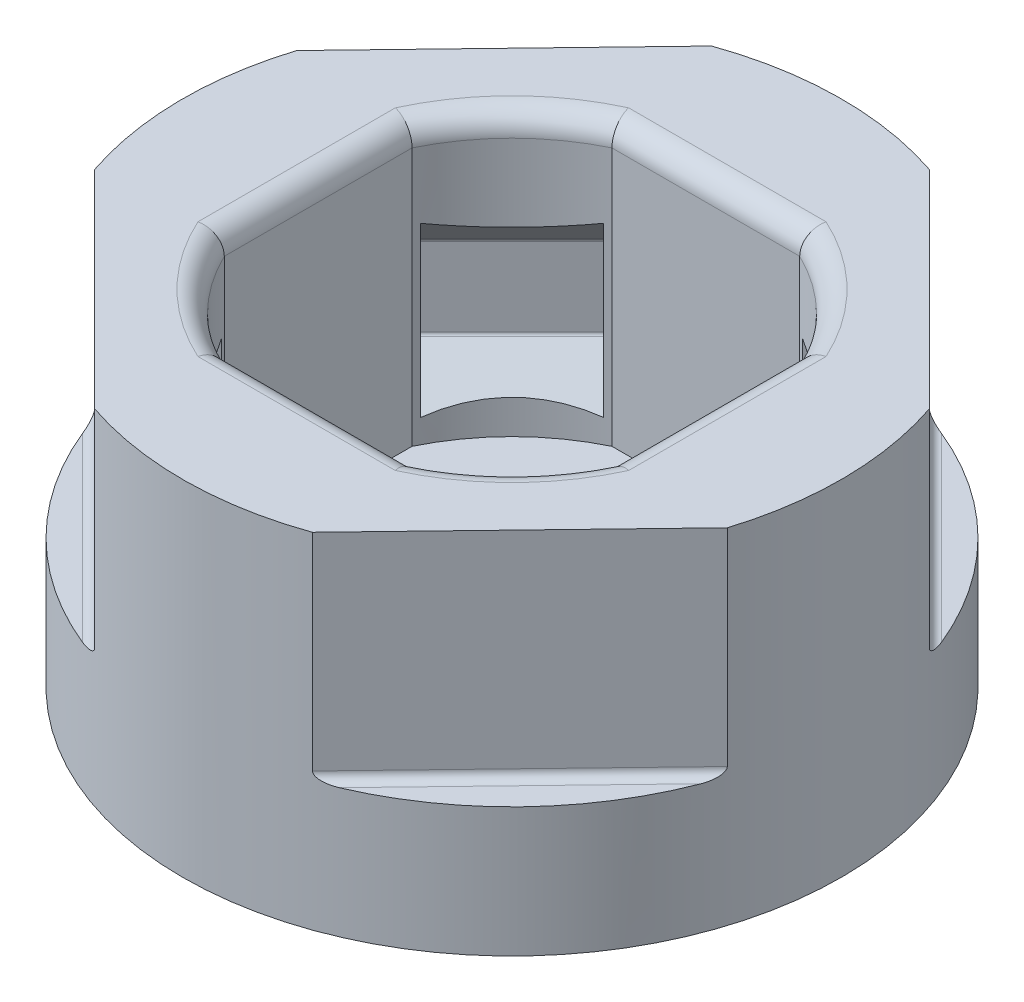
ISO-10303-21;
HEADER;
FILE_DESCRIPTION(('STEP AP214'),'2;1');
FILE_NAME('part.step','',(''),(''),'','','');
FILE_SCHEMA(('AUTOMOTIVE_DESIGN { 1 0 10303 214 1 1 1 1 }'));
ENDSEC;
DATA;
#1=APPLICATION_CONTEXT('core data for automotive mechanical design processes');
#2=APPLICATION_PROTOCOL_DEFINITION('international standard','automotive_design',2000,#1);
#3=PRODUCT_CONTEXT('',#1,'mechanical');
#4=PRODUCT('Part','Part','',(#3));
#5=PRODUCT_RELATED_PRODUCT_CATEGORY('part','',(#4));
#6=PRODUCT_DEFINITION_FORMATION('','',#4);
#7=PRODUCT_DEFINITION_CONTEXT('part definition',#1,'design');
#8=PRODUCT_DEFINITION('design','',#6,#7);
#9=PRODUCT_DEFINITION_SHAPE('','',#8);
#10=(LENGTH_UNIT() NAMED_UNIT(*) SI_UNIT(.MILLI.,.METRE.));
#11=(NAMED_UNIT(*) PLANE_ANGLE_UNIT() SI_UNIT($,.RADIAN.));
#12=(NAMED_UNIT(*) SI_UNIT($,.STERADIAN.) SOLID_ANGLE_UNIT());
#13=UNCERTAINTY_MEASURE_WITH_UNIT(LENGTH_MEASURE(1.E-05),#10,'distance_accuracy_value','');
#14=(GEOMETRIC_REPRESENTATION_CONTEXT(3) GLOBAL_UNCERTAINTY_ASSIGNED_CONTEXT((#13)) GLOBAL_UNIT_ASSIGNED_CONTEXT((#10,
#11,#12)) REPRESENTATION_CONTEXT('',''));
#15=CARTESIAN_POINT('',(0.,0.,0.));
#16=DIRECTION('',(0.,0.,1.));
#17=DIRECTION('',(1.,0.,0.));
#18=AXIS2_PLACEMENT_3D('',#15,#16,#17);
#19=CARTESIAN_POINT('',(0.,1.5,0.));
#20=DIRECTION('',(0.,1.,0.));
#21=DIRECTION('',(0.,0.,1.));
#22=AXIS2_PLACEMENT_3D('',#19,#20,#21);
#23=CYLINDRICAL_SURFACE('',#22,5.);
#24=DIRECTION('',(0.,1.,0.));
#25=VECTOR('',#24,1.);
#26=CARTESIAN_POINT('',(-4.5,1.5,2.17944947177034));
#27=LINE('',#26,#25);
#28=CARTESIAN_POINT('',(-4.5,1.5,2.17944947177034));
#29=VERTEX_POINT('',#28);
#30=CARTESIAN_POINT('',(-4.5,7.5,2.17944947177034));
#31=VERTEX_POINT('',#30);
#32=EDGE_CURVE('E831',#29,#31,#27,.T.);
#33=ORIENTED_EDGE('',*,*,#32,.T.);
#34=CARTESIAN_POINT('',(0.,7.5,0.));
#35=DIRECTION('',(0.,1.,0.));
#36=DIRECTION('',(0.,0.,1.));
#37=AXIS2_PLACEMENT_3D('',#34,#35,#36);
#38=CIRCLE('',#37,5.);
#39=CARTESIAN_POINT('',(-2.17944947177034,7.5,4.5));
#40=VERTEX_POINT('',#39);
#41=EDGE_CURVE('E868',#31,#40,#38,.T.);
#42=ORIENTED_EDGE('',*,*,#41,.T.);
#43=DIRECTION('',(0.,1.,0.));
#44=VECTOR('',#43,1.);
#45=CARTESIAN_POINT('',(-2.17944947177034,1.5,4.5));
#46=LINE('',#45,#44);
#47=CARTESIAN_POINT('',(-2.17944947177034,1.5,4.5));
#48=VERTEX_POINT('',#47);
#49=EDGE_CURVE('E826',#48,#40,#46,.T.);
#50=ORIENTED_EDGE('',*,*,#49,.F.);
#51=CARTESIAN_POINT('',(0.,1.5,0.));
#52=DIRECTION('',(0.,1.,0.));
#53=DIRECTION('',(0.,0.,1.));
#54=AXIS2_PLACEMENT_3D('',#51,#52,#53);
#55=CIRCLE('',#54,5.);
#56=EDGE_CURVE('E814',#29,#48,#55,.T.);
#57=ORIENTED_EDGE('',*,*,#56,.F.);
#58=EDGE_LOOP('',(#33,#42,#50,#57));
#59=FACE_BOUND('',#58,.T.);
#60=CARTESIAN_POINT('',(0.,10.9592382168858,0.));
#61=DIRECTION('',(0.512042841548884,-0.689655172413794,-0.512042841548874));
#62=DIRECTION('',(0.487659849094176,0.724137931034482,-0.487659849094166));
#63=AXIS2_PLACEMENT_3D('',#60,#61,#62);
#64=ELLIPSE('',#63,7.25,5.);
#65=CARTESIAN_POINT('',(-4.43334456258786,5.95105740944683,2.31202421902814));
#66=VERTEX_POINT('',#65);
#67=CARTESIAN_POINT('',(-2.31202421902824,5.95105740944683,4.43334456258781));
#68=VERTEX_POINT('',#67);
#69=EDGE_CURVE('E413',#66,#68,#64,.F.);
#70=ORIENTED_EDGE('',*,*,#69,.F.);
#71=DIRECTION('',(0.,1.,0.));
#72=VECTOR('',#71,1.);
#73=CARTESIAN_POINT('',(-4.43334456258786,1.5,2.31202421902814));
#74=LINE('',#73,#72);
#75=CARTESIAN_POINT('',(-4.43334456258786,2.04894259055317,2.31202421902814));
#76=VERTEX_POINT('',#75);
#77=EDGE_CURVE('E399',#76,#66,#74,.T.);
#78=ORIENTED_EDGE('',*,*,#77,.F.);
#79=CARTESIAN_POINT('',(0.,-2.95923821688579,0.));
#80=DIRECTION('',(0.512042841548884,0.689655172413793,-0.512042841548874));
#81=DIRECTION('',(-0.487659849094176,0.724137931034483,0.487659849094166));
#82=AXIS2_PLACEMENT_3D('',#79,#80,#81);
#83=ELLIPSE('',#82,7.25,5.);
#84=CARTESIAN_POINT('',(-2.31202421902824,2.04894259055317,4.43334456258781));
#85=VERTEX_POINT('',#84);
#86=EDGE_CURVE('E388',#85,#76,#83,.F.);
#87=ORIENTED_EDGE('',*,*,#86,.F.);
#88=DIRECTION('',(0.,1.,0.));
#89=VECTOR('',#88,1.);
#90=CARTESIAN_POINT('',(-2.31202421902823,1.5,4.43334456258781));
#91=LINE('',#90,#89);
#92=EDGE_CURVE('E415',#68,#85,#91,.F.);
#93=ORIENTED_EDGE('',*,*,#92,.F.);
#94=EDGE_LOOP('',(#70,#78,#87,#93));
#95=FACE_BOUND('',#94,.T.);
#96=ADVANCED_FACE('F77',(#59,#95),#23,.F.);
#97=DIRECTION('',(0.,1.,0.));
#98=VECTOR('',#97,1.);
#99=CARTESIAN_POINT('',(2.17944947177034,1.5,4.5));
#100=LINE('',#99,#98);
#101=CARTESIAN_POINT('',(2.17944947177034,1.5,4.5));
#102=VERTEX_POINT('',#101);
#103=CARTESIAN_POINT('',(2.17944947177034,7.5,4.5));
#104=VERTEX_POINT('',#103);
#105=EDGE_CURVE('E855',#102,#104,#100,.T.);
#106=ORIENTED_EDGE('',*,*,#105,.T.);
#107=CARTESIAN_POINT('',(0.,7.5,0.));
#108=DIRECTION('',(0.,1.,0.));
#109=DIRECTION('',(0.,0.,1.));
#110=AXIS2_PLACEMENT_3D('',#107,#108,#109);
#111=CIRCLE('',#110,5.);
#112=CARTESIAN_POINT('',(4.5,7.5,2.17944947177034));
#113=VERTEX_POINT('',#112);
#114=EDGE_CURVE('E900',#104,#113,#111,.T.);
#115=ORIENTED_EDGE('',*,*,#114,.T.);
#116=DIRECTION('',(0.,1.,0.));
#117=VECTOR('',#116,1.);
#118=CARTESIAN_POINT('',(4.5,1.5,2.17944947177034));
#119=LINE('',#118,#117);
#120=CARTESIAN_POINT('',(4.5,1.5,2.17944947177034));
#121=VERTEX_POINT('',#120);
#122=EDGE_CURVE('E851',#121,#113,#119,.T.);
#123=ORIENTED_EDGE('',*,*,#122,.F.);
#124=EDGE_CURVE('E808',#102,#121,#55,.T.);
#125=ORIENTED_EDGE('',*,*,#124,.F.);
#126=EDGE_LOOP('',(#106,#115,#123,#125));
#127=FACE_BOUND('',#126,.T.);
#128=CARTESIAN_POINT('',(0.,10.9592382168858,0.));
#129=DIRECTION('',(-0.512042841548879,-0.689655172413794,-0.512042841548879));
#130=DIRECTION('',(-0.487659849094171,0.724137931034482,-0.487659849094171));
#131=AXIS2_PLACEMENT_3D('',#128,#129,#130);
#132=ELLIPSE('',#131,7.25,5.);
#133=CARTESIAN_POINT('',(2.31202421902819,5.95105740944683,4.43334456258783));
#134=VERTEX_POINT('',#133);
#135=CARTESIAN_POINT('',(4.43334456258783,5.95105740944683,2.31202421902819));
#136=VERTEX_POINT('',#135);
#137=EDGE_CURVE('E400',#134,#136,#132,.F.);
#138=ORIENTED_EDGE('',*,*,#137,.F.);
#139=DIRECTION('',(0.,1.,0.));
#140=VECTOR('',#139,1.);
#141=CARTESIAN_POINT('',(2.31202421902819,1.5,4.43334456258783));
#142=LINE('',#141,#140);
#143=CARTESIAN_POINT('',(2.31202421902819,2.04894259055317,4.43334456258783));
#144=VERTEX_POINT('',#143);
#145=EDGE_CURVE('E1241',#144,#134,#142,.T.);
#146=ORIENTED_EDGE('',*,*,#145,.F.);
#147=CARTESIAN_POINT('',(0.,-2.95923821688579,0.));
#148=DIRECTION('',(-0.512042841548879,0.689655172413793,-0.512042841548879));
#149=DIRECTION('',(0.487659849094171,0.724137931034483,0.487659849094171));
#150=AXIS2_PLACEMENT_3D('',#147,#148,#149);
#151=ELLIPSE('',#150,7.25,5.);
#152=CARTESIAN_POINT('',(4.43334456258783,2.04894259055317,2.31202421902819));
#153=VERTEX_POINT('',#152);
#154=EDGE_CURVE('E1238',#153,#144,#151,.F.);
#155=ORIENTED_EDGE('',*,*,#154,.F.);
#156=DIRECTION('',(0.,1.,0.));
#157=VECTOR('',#156,1.);
#158=CARTESIAN_POINT('',(4.43334456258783,1.5,2.31202421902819));
#159=LINE('',#158,#157);
#160=EDGE_CURVE('E1244',#136,#153,#159,.F.);
#161=ORIENTED_EDGE('',*,*,#160,.F.);
#162=EDGE_LOOP('',(#138,#146,#155,#161));
#163=FACE_BOUND('',#162,.T.);
#164=ADVANCED_FACE('F1126',(#127,#163),#23,.F.);
#165=DIRECTION('',(0.,1.,0.));
#166=VECTOR('',#165,1.);
#167=CARTESIAN_POINT('',(4.5,1.5,-2.17944947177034));
#168=LINE('',#167,#166);
#169=CARTESIAN_POINT('',(4.5,1.5,-2.17944947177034));
#170=VERTEX_POINT('',#169);
#171=CARTESIAN_POINT('',(4.5,7.5,-2.17944947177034));
#172=VERTEX_POINT('',#171);
#173=EDGE_CURVE('E847',#170,#172,#168,.T.);
#174=ORIENTED_EDGE('',*,*,#173,.T.);
#175=CARTESIAN_POINT('',(0.,7.5,0.));
#176=DIRECTION('',(0.,1.,0.));
#177=DIRECTION('',(0.,0.,1.));
#178=AXIS2_PLACEMENT_3D('',#175,#176,#177);
#179=CIRCLE('',#178,5.);
#180=CARTESIAN_POINT('',(2.17944947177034,7.5,-4.5));
#181=VERTEX_POINT('',#180);
#182=EDGE_CURVE('E906',#172,#181,#179,.T.);
#183=ORIENTED_EDGE('',*,*,#182,.T.);
#184=DIRECTION('',(0.,1.,0.));
#185=VECTOR('',#184,1.);
#186=CARTESIAN_POINT('',(2.17944947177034,1.5,-4.5));
#187=LINE('',#186,#185);
#188=CARTESIAN_POINT('',(2.17944947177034,1.5,-4.5));
#189=VERTEX_POINT('',#188);
#190=EDGE_CURVE('E843',#189,#181,#187,.T.);
#191=ORIENTED_EDGE('',*,*,#190,.F.);
#192=EDGE_CURVE('E815',#170,#189,#55,.T.);
#193=ORIENTED_EDGE('',*,*,#192,.F.);
#194=EDGE_LOOP('',(#174,#183,#191,#193));
#195=FACE_BOUND('',#194,.T.);
#196=CARTESIAN_POINT('',(0.,10.9592382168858,0.));
#197=DIRECTION('',(-0.51204284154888,-0.689655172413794,0.512042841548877));
#198=DIRECTION('',(-0.487659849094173,0.724137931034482,0.48765984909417));
#199=AXIS2_PLACEMENT_3D('',#196,#197,#198);
#200=ELLIPSE('',#199,7.25,5.);
#201=CARTESIAN_POINT('',(4.43334456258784,5.95105740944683,-2.31202421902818));
#202=VERTEX_POINT('',#201);
#203=CARTESIAN_POINT('',(2.3120242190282,5.95105740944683,-4.43334456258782));
#204=VERTEX_POINT('',#203);
#205=EDGE_CURVE('E1235',#202,#204,#200,.F.);
#206=ORIENTED_EDGE('',*,*,#205,.F.);
#207=DIRECTION('',(0.,1.,0.));
#208=VECTOR('',#207,1.);
#209=CARTESIAN_POINT('',(4.43334456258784,1.5,-2.31202421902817));
#210=LINE('',#209,#208);
#211=CARTESIAN_POINT('',(4.43334456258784,2.04894259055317,-2.31202421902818));
#212=VERTEX_POINT('',#211);
#213=EDGE_CURVE('E1229',#212,#202,#210,.T.);
#214=ORIENTED_EDGE('',*,*,#213,.F.);
#215=CARTESIAN_POINT('',(0.,-2.95923821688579,0.));
#216=DIRECTION('',(-0.512042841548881,0.689655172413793,0.512042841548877));
#217=DIRECTION('',(0.487659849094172,0.724137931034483,-0.487659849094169));
#218=AXIS2_PLACEMENT_3D('',#215,#216,#217);
#219=ELLIPSE('',#218,7.25,5.);
#220=CARTESIAN_POINT('',(2.3120242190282,2.04894259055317,-4.43334456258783));
#221=VERTEX_POINT('',#220);
#222=EDGE_CURVE('E1226',#221,#212,#219,.F.);
#223=ORIENTED_EDGE('',*,*,#222,.F.);
#224=DIRECTION('',(0.,1.,0.));
#225=VECTOR('',#224,1.);
#226=CARTESIAN_POINT('',(2.3120242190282,1.5,-4.43334456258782));
#227=LINE('',#226,#225);
#228=EDGE_CURVE('E714',#204,#221,#227,.F.);
#229=ORIENTED_EDGE('',*,*,#228,.F.);
#230=EDGE_LOOP('',(#206,#214,#223,#229));
#231=FACE_BOUND('',#230,.T.);
#232=ADVANCED_FACE('F1132',(#195,#231),#23,.F.);
#233=DIRECTION('',(0.,1.,0.));
#234=VECTOR('',#233,1.);
#235=CARTESIAN_POINT('',(-2.17944947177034,1.5,-4.5));
#236=LINE('',#235,#234);
#237=CARTESIAN_POINT('',(-2.17944947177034,1.5,-4.5));
#238=VERTEX_POINT('',#237);
#239=CARTESIAN_POINT('',(-2.17944947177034,7.5,-4.5));
#240=VERTEX_POINT('',#239);
#241=EDGE_CURVE('E839',#238,#240,#236,.T.);
#242=ORIENTED_EDGE('',*,*,#241,.T.);
#243=CARTESIAN_POINT('',(0.,7.5,0.));
#244=DIRECTION('',(0.,1.,0.));
#245=DIRECTION('',(0.,0.,1.));
#246=AXIS2_PLACEMENT_3D('',#243,#244,#245);
#247=CIRCLE('',#246,5.);
#248=CARTESIAN_POINT('',(-4.5,7.5,-2.17944947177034));
#249=VERTEX_POINT('',#248);
#250=EDGE_CURVE('E912',#240,#249,#247,.T.);
#251=ORIENTED_EDGE('',*,*,#250,.T.);
#252=DIRECTION('',(0.,1.,0.));
#253=VECTOR('',#252,1.);
#254=CARTESIAN_POINT('',(-4.5,1.5,-2.17944947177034));
#255=LINE('',#254,#253);
#256=CARTESIAN_POINT('',(-4.5,1.5,-2.17944947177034));
#257=VERTEX_POINT('',#256);
#258=EDGE_CURVE('E835',#257,#249,#255,.T.);
#259=ORIENTED_EDGE('',*,*,#258,.F.);
#260=EDGE_CURVE('E822',#238,#257,#55,.T.);
#261=ORIENTED_EDGE('',*,*,#260,.F.);
#262=EDGE_LOOP('',(#242,#251,#259,#261));
#263=FACE_BOUND('',#262,.T.);
#264=CARTESIAN_POINT('',(0.,10.9592382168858,0.));
#265=DIRECTION('',(0.512042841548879,-0.689655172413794,0.512042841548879));
#266=DIRECTION('',(0.487659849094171,0.724137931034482,0.487659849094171));
#267=AXIS2_PLACEMENT_3D('',#264,#265,#266);
#268=ELLIPSE('',#267,7.25,5.);
#269=CARTESIAN_POINT('',(-2.31202421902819,5.95105740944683,-4.43334456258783));
#270=VERTEX_POINT('',#269);
#271=CARTESIAN_POINT('',(-4.43334456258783,5.95105740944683,-2.31202421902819));
#272=VERTEX_POINT('',#271);
#273=EDGE_CURVE('E1148',#270,#272,#268,.F.);
#274=ORIENTED_EDGE('',*,*,#273,.F.);
#275=DIRECTION('',(0.,1.,0.));
#276=VECTOR('',#275,1.);
#277=CARTESIAN_POINT('',(-2.31202421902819,1.5,-4.43334456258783));
#278=LINE('',#277,#276);
#279=CARTESIAN_POINT('',(-2.31202421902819,2.04894259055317,-4.43334456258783));
#280=VERTEX_POINT('',#279);
#281=EDGE_CURVE('E1150',#280,#270,#278,.T.);
#282=ORIENTED_EDGE('',*,*,#281,.F.);
#283=CARTESIAN_POINT('',(0.,-2.95923821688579,0.));
#284=DIRECTION('',(0.512042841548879,0.689655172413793,0.512042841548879));
#285=DIRECTION('',(-0.487659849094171,0.724137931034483,-0.487659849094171));
#286=AXIS2_PLACEMENT_3D('',#283,#284,#285);
#287=ELLIPSE('',#286,7.25,5.);
#288=CARTESIAN_POINT('',(-4.43334456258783,2.04894259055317,-2.31202421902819));
#289=VERTEX_POINT('',#288);
#290=EDGE_CURVE('E1984',#289,#280,#287,.F.);
#291=ORIENTED_EDGE('',*,*,#290,.F.);
#292=DIRECTION('',(0.,1.,0.));
#293=VECTOR('',#292,1.);
#294=CARTESIAN_POINT('',(-4.43334456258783,1.5,-2.31202421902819));
#295=LINE('',#294,#293);
#296=EDGE_CURVE('E1152',#272,#289,#295,.F.);
#297=ORIENTED_EDGE('',*,*,#296,.F.);
#298=EDGE_LOOP('',(#274,#282,#291,#297));
#299=FACE_BOUND('',#298,.T.);
#300=ADVANCED_FACE('F1047',(#263,#299),#23,.F.);
#301=CARTESIAN_POINT('',(0.,8.,0.));
#302=DIRECTION('',(0.,-1.,0.));
#303=DIRECTION('',(0.,0.,-1.));
#304=AXIS2_PLACEMENT_3D('',#301,#302,#303);
#305=CYLINDRICAL_SURFACE('',#304,7.65);
#306=CARTESIAN_POINT('',(0.,0.,0.));
#307=DIRECTION('',(0.,1.,0.));
#308=DIRECTION('',(0.,0.,1.));
#309=AXIS2_PLACEMENT_3D('',#306,#307,#308);
#310=CIRCLE('',#309,7.65);
#311=CARTESIAN_POINT('',(0.,0.,7.65));
#312=VERTEX_POINT('',#311);
#313=EDGE_CURVE('E830',#312,#312,#310,.T.);
#314=ORIENTED_EDGE('',*,*,#313,.T.);
#315=EDGE_LOOP('',(#314));
#316=FACE_BOUND('',#315,.T.);
#317=CARTESIAN_POINT('',(0.,3.,0.));
#318=DIRECTION('',(0.,1.,0.));
#319=DIRECTION('',(0.,0.,1.));
#320=AXIS2_PLACEMENT_3D('',#317,#318,#319);
#321=CIRCLE('',#320,7.65);
#322=CARTESIAN_POINT('',(3.01847019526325,3.,7.02931985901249));
#323=VERTEX_POINT('',#322);
#324=CARTESIAN_POINT('',(7.13835563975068,3.,2.75070513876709));
#325=VERTEX_POINT('',#324);
#326=EDGE_CURVE('E776',#323,#325,#321,.T.);
#327=ORIENTED_EDGE('',*,*,#326,.F.);
#328=CARTESIAN_POINT('',(3.01847019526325,3.,7.02931985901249));
#329=CARTESIAN_POINT('',(2.99751023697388,3.00001174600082,7.03832092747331));
#330=CARTESIAN_POINT('',(2.97650084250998,3.00058940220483,7.04723096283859));
#331=CARTESIAN_POINT('',(2.93440036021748,3.00303338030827,7.06486480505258));
#332=CARTESIAN_POINT('',(2.91330922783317,3.0049038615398,7.07358791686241));
#333=CARTESIAN_POINT('',(2.87133232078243,3.01007583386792,7.09073071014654));
#334=CARTESIAN_POINT('',(2.8504460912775,3.01336819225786,7.09915196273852));
#335=CARTESIAN_POINT('',(2.80890966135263,3.02163882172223,7.11568860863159));
#336=CARTESIAN_POINT('',(2.78825915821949,3.02661459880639,7.12380443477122));
#337=CARTESIAN_POINT('',(2.75519003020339,3.03637783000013,7.13663874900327));
#338=CARTESIAN_POINT('',(2.74262664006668,3.04051766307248,7.14147577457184));
#339=CARTESIAN_POINT('',(2.71771470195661,3.04978909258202,7.15099330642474));
#340=CARTESIAN_POINT('',(2.70536770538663,3.05492599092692,7.15567281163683));
#341=CARTESIAN_POINT('',(2.6772148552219,3.06823592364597,7.16626219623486));
#342=CARTESIAN_POINT('',(2.66158159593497,3.07685359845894,7.17208062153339));
#343=CARTESIAN_POINT('',(2.63197562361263,3.09691160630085,7.18299695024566));
#344=CARTESIAN_POINT('',(2.61798892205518,3.10832516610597,7.18810100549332));
#345=CARTESIAN_POINT('',(2.60161175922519,3.12639462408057,7.19403490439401));
#346=CARTESIAN_POINT('',(2.59758115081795,3.13133912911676,7.19549081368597));
#347=CARTESIAN_POINT('',(2.59016449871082,3.14176507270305,7.19816386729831));
#348=CARTESIAN_POINT('',(2.58677890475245,3.14724688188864,7.19938084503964));
#349=CARTESIAN_POINT('',(2.5808457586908,3.15881488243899,7.20150993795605));
#350=CARTESIAN_POINT('',(2.57831092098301,3.16490861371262,7.20241743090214));
#351=CARTESIAN_POINT('',(2.57443624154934,3.17750458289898,7.20380333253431));
#352=CARTESIAN_POINT('',(2.57309138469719,3.18400498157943,7.20428354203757));
#353=CARTESIAN_POINT('',(2.57227784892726,3.19213606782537,7.20457400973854));
#354=CARTESIAN_POINT('',(2.57216029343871,3.19370632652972,7.20461598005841));
#355=CARTESIAN_POINT('',(2.57200347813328,3.19685080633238,7.20467196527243));
#356=CARTESIAN_POINT('',(2.57196419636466,3.19842502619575,7.20468598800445));
#357=CARTESIAN_POINT('',(2.57196397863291,3.2,7.20468606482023));
#358=B_SPLINE_CURVE_WITH_KNOTS('',3,(#328,#329,#330,#331,#332,#333,#334,#335,#336,#337,#338,
#339,#340,#341,#342,#343,#344,#345,#346,#347,#348,#349,#350,#351,#352,#353,#354,#355,#356,#357),
.UNSPECIFIED.,.F.,.F.,(4,2,2,2,2,2,2,2,2,2,2,2,2,2,4),(0.,0.0684404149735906,0.137102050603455,
0.2053290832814,0.273455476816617,0.315680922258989,0.358137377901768,0.41432281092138,
0.469989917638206,0.489574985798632,0.509173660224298,0.529053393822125,0.548848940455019,
0.55357313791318,0.558296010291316),.UNSPECIFIED.);
#359=CARTESIAN_POINT('',(2.57196397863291,3.2,7.20468606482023));
#360=VERTEX_POINT('',#359);
#361=EDGE_CURVE('E1071',#323,#360,#358,.T.);
#362=ORIENTED_EDGE('',*,*,#361,.T.);
#363=DIRECTION('',(0.,1.,0.));
#364=VECTOR('',#363,1.);
#365=CARTESIAN_POINT('',(2.57196397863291,3.,7.20468606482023));
#366=LINE('',#365,#364);
#367=CARTESIAN_POINT('',(2.57196397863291,8.,7.20468606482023));
#368=VERTEX_POINT('',#367);
#369=EDGE_CURVE('E780',#360,#368,#366,.T.);
#370=ORIENTED_EDGE('',*,*,#369,.T.);
#371=CARTESIAN_POINT('',(0.,8.,0.));
#372=DIRECTION('',(0.,1.,0.));
#373=DIRECTION('',(0.,0.,1.));
#374=AXIS2_PLACEMENT_3D('',#371,#372,#373);
#375=CIRCLE('',#374,7.65);
#376=CARTESIAN_POINT('',(-2.43536253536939,8.,7.25200036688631));
#377=VERTEX_POINT('',#376);
#378=EDGE_CURVE('E859',#377,#368,#375,.T.);
#379=ORIENTED_EDGE('',*,*,#378,.F.);
#380=DIRECTION('',(0.,1.,0.));
#381=VECTOR('',#380,1.);
#382=CARTESIAN_POINT('',(-2.43536253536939,3.,7.25200036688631));
#383=LINE('',#382,#381);
#384=CARTESIAN_POINT('',(-2.43536253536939,3.2,7.25200036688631));
#385=VERTEX_POINT('',#384);
#386=EDGE_CURVE('E756',#385,#377,#383,.T.);
#387=ORIENTED_EDGE('',*,*,#386,.F.);
#388=CARTESIAN_POINT('',(-2.43536253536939,3.2,7.25200036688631));
#389=CARTESIAN_POINT('',(-2.43534900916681,3.19453266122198,7.25200473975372));
#390=CARTESIAN_POINT('',(-2.43583919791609,3.18908373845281,7.25184030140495));
#391=CARTESIAN_POINT('',(-2.43770220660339,3.17841636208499,7.25121434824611));
#392=CARTESIAN_POINT('',(-2.43906516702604,3.1731960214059,7.25075615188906));
#393=CARTESIAN_POINT('',(-2.442965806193,3.1618540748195,7.24944293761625));
#394=CARTESIAN_POINT('',(-2.44570492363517,3.15581086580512,7.24851974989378));
#395=CARTESIAN_POINT('',(-2.45207234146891,3.14425327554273,7.24636824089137));
#396=CARTESIAN_POINT('',(-2.45570468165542,3.13874145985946,7.24513853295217));
#397=CARTESIAN_POINT('',(-2.46590577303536,3.12522470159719,7.24167464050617));
#398=CARTESIAN_POINT('',(-2.4729551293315,3.11762973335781,7.23927172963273));
#399=CARTESIAN_POINT('',(-2.4880111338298,3.10362292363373,7.23411121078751));
#400=CARTESIAN_POINT('',(-2.49601959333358,3.09721338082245,7.23135293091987));
#401=CARTESIAN_POINT('',(-2.5204905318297,3.079740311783,7.22287454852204));
#402=CARTESIAN_POINT('',(-2.53778118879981,3.07001282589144,7.21682180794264));
#403=CARTESIAN_POINT('',(-2.57343774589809,3.05305335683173,7.20418512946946));
#404=CARTESIAN_POINT('',(-2.5918104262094,3.04583963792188,7.19759771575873));
#405=CARTESIAN_POINT('',(-2.63313811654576,3.03197689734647,7.18259459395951));
#406=CARTESIAN_POINT('',(-2.65621735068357,3.02579551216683,7.17409385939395));
#407=CARTESIAN_POINT('',(-2.70274232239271,3.01561772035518,7.15669646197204));
#408=CARTESIAN_POINT('',(-2.7261887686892,3.0116262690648,7.14779895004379));
#409=CARTESIAN_POINT('',(-2.77228375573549,3.00557293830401,7.13004405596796));
#410=CARTESIAN_POINT('',(-2.7949281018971,3.00344242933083,7.12119841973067));
#411=CARTESIAN_POINT('',(-2.84010104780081,3.00066718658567,7.10330320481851));
#412=CARTESIAN_POINT('',(-2.86262967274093,3.00001524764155,7.09425483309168));
#413=CARTESIAN_POINT('',(-2.88510280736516,3.,7.08510280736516));
#414=B_SPLINE_CURVE_WITH_KNOTS('',3,(#388,#389,#390,#391,#392,#393,#394,#395,#396,#397,#398,
#399,#400,#401,#402,#403,#404,#405,#406,#407,#408,#409,#410,#411,#412,#413),.UNSPECIFIED.,.F.,
.F.,(4,2,2,2,2,2,2,2,2,2,2,2,4),(0.,0.0163478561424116,0.0325142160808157,0.0524993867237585,
0.0725766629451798,0.104308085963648,0.136100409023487,0.197979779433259,0.260299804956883,
0.336234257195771,0.412339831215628,0.485503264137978,0.558309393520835),.UNSPECIFIED.);
#415=CARTESIAN_POINT('',(-2.88510280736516,3.,7.08510280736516));
#416=VERTEX_POINT('',#415);
#417=EDGE_CURVE('E1077',#385,#416,#414,.T.);
#418=ORIENTED_EDGE('',*,*,#417,.T.);
#419=CARTESIAN_POINT('',(0.,3.,0.));
#420=DIRECTION('',(0.,1.,0.));
#421=DIRECTION('',(0.,0.,1.));
#422=AXIS2_PLACEMENT_3D('',#419,#420,#421);
#423=CIRCLE('',#422,7.65);
#424=CARTESIAN_POINT('',(-7.08510280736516,3.,2.88510280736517));
#425=VERTEX_POINT('',#424);
#426=EDGE_CURVE('E746',#425,#416,#423,.T.);
#427=ORIENTED_EDGE('',*,*,#426,.F.);
#428=CARTESIAN_POINT('',(-7.08510280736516,3.,2.88510280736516));
#429=CARTESIAN_POINT('',(-7.09370620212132,3.00001174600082,2.86397650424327));
#430=CARTESIAN_POINT('',(-7.10221764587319,3.00058940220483,2.8428024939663));
#431=CARTESIAN_POINT('',(-7.11905279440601,3.00303338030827,2.80037631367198));
#432=CARTESIAN_POINT('',(-7.12737580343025,3.0049038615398,2.77912411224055));
#433=CARTESIAN_POINT('',(-7.14372232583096,3.01007583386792,2.73683076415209));
#434=CARTESIAN_POINT('',(-7.15174740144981,3.01336819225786,2.71578913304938));
#435=CARTESIAN_POINT('',(-7.16749620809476,3.02163882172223,2.67394763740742));
#436=CARTESIAN_POINT('',(-7.17522036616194,3.02661459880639,2.65314746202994));
#437=CARTESIAN_POINT('',(-7.18742750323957,3.03637783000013,2.61984171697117));
#438=CARTESIAN_POINT('',(-7.19202626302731,3.04051766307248,2.6071891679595));
#439=CARTESIAN_POINT('',(-7.20107135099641,3.04978909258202,2.58210183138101));
#440=CARTESIAN_POINT('',(-7.20551670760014,3.05492599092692,2.56966861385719));
#441=CARTESIAN_POINT('',(-7.2155722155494,3.06823592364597,2.54132068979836));
#442=CARTESIAN_POINT('',(-7.22109419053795,3.07685359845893,2.5255802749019));
#443=CARTESIAN_POINT('',(-7.23144912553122,3.09691160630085,2.49577331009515));
#444=CARTESIAN_POINT('',(-7.23628797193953,3.10832516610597,2.48169265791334));
#445=CARTESIAN_POINT('',(-7.24191134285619,3.12639462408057,2.46520629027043));
#446=CARTESIAN_POINT('',(-7.24329082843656,3.13133912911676,2.46114889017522));
#447=CARTESIAN_POINT('',(-7.24582325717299,3.14176507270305,2.45368305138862));
#448=CARTESIAN_POINT('',(-7.24697604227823,3.14724688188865,2.45027506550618));
#449=CARTESIAN_POINT('',(-7.24899264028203,3.15881488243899,2.4443027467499));
#450=CARTESIAN_POINT('',(-7.24985207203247,3.16490861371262,2.44175121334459));
#451=CARTESIAN_POINT('',(-7.2511645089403,3.17750458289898,2.43785103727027));
#452=CARTESIAN_POINT('',(-7.25161921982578,3.18400498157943,2.43649734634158));
#453=CARTESIAN_POINT('',(-7.2518942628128,3.19213606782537,2.43567846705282));
#454=CARTESIAN_POINT('',(-7.25193400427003,3.19370632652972,2.43556013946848));
#455=CARTESIAN_POINT('',(-7.2519870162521,3.19685080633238,2.43540229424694));
#456=CARTESIAN_POINT('',(-7.25200029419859,3.19842502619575,2.4353627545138));
#457=CARTESIAN_POINT('',(-7.25200036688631,3.2,2.4353625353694));
#458=B_SPLINE_CURVE_WITH_KNOTS('',3,(#428,#429,#430,#431,#432,#433,#434,#435,#436,#437,#438,
#439,#440,#441,#442,#443,#444,#445,#446,#447,#448,#449,#450,#451,#452,#453,#454,#455,#456,#457),
.UNSPECIFIED.,.F.,.F.,(4,2,2,2,2,2,2,2,2,2,2,2,2,2,4),(0.,0.0684404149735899,0.137102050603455,
0.205329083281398,0.273455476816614,0.315680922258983,0.358137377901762,0.414322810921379,
0.469989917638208,0.489574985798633,0.509173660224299,0.529053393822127,0.548848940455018,
0.55357313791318,0.558296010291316),.UNSPECIFIED.);
#459=CARTESIAN_POINT('',(-7.25200036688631,3.2,2.43536253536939));
#460=VERTEX_POINT('',#459);
#461=EDGE_CURVE('E1084',#425,#460,#458,.T.);
#462=ORIENTED_EDGE('',*,*,#461,.T.);
#463=DIRECTION('',(0.,1.,0.));
#464=VECTOR('',#463,1.);
#465=CARTESIAN_POINT('',(-7.25200036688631,3.,2.43536253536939));
#466=LINE('',#465,#464);
#467=CARTESIAN_POINT('',(-7.25200036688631,8.,2.43536253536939));
#468=VERTEX_POINT('',#467);
#469=EDGE_CURVE('E750',#460,#468,#466,.T.);
#470=ORIENTED_EDGE('',*,*,#469,.T.);
#471=CARTESIAN_POINT('',(-7.29672495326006,8.,-2.29789141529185));
#472=VERTEX_POINT('',#471);
#473=EDGE_CURVE('E863',#472,#468,#375,.T.);
#474=ORIENTED_EDGE('',*,*,#473,.F.);
#475=DIRECTION('',(0.,1.,0.));
#476=VECTOR('',#475,1.);
#477=CARTESIAN_POINT('',(-7.29672495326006,3.,-2.29789141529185));
#478=LINE('',#477,#476);
#479=CARTESIAN_POINT('',(-7.29672495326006,3.2,-2.29789141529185));
#480=VERTEX_POINT('',#479);
#481=EDGE_CURVE('E766',#480,#472,#478,.T.);
#482=ORIENTED_EDGE('',*,*,#481,.F.);
#483=CARTESIAN_POINT('',(-7.29672495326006,3.2,-2.29789141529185));
#484=CARTESIAN_POINT('',(-7.29672906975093,3.19453266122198,-2.2978778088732));
#485=CARTESIAN_POINT('',(-7.29657392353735,3.18908373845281,-2.29837101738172));
#486=CARTESIAN_POINT('',(-7.29598328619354,3.17841636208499,-2.30024552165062));
#487=CARTESIAN_POINT('',(-7.29555092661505,3.1731960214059,-2.30161689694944));
#488=CARTESIAN_POINT('',(-7.29431165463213,3.1618540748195,-2.30554165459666));
#489=CARTESIAN_POINT('',(-7.29344039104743,3.15581086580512,-2.30829772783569));
#490=CARTESIAN_POINT('',(-7.29140958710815,3.14425327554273,-2.31470466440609));
#491=CARTESIAN_POINT('',(-7.29024873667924,3.13874145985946,-2.31835959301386));
#492=CARTESIAN_POINT('',(-7.28697822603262,3.12522470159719,-2.32862431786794));
#493=CARTESIAN_POINT('',(-7.28470895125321,3.11762973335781,-2.3357178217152));
#494=CARTESIAN_POINT('',(-7.27983385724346,3.10362292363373,-2.35086865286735));
#495=CARTESIAN_POINT('',(-7.2772274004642,3.09721338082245,-2.35892780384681));
#496=CARTESIAN_POINT('',(-7.26921294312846,3.079740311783,-2.38355458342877));
#497=CARTESIAN_POINT('',(-7.26348801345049,3.07001282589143,-2.40095652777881));
#498=CARTESIAN_POINT('',(-7.25152736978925,3.05305335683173,-2.43684550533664));
#499=CARTESIAN_POINT('',(-7.2452883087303,3.04583963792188,-2.45533938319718));
#500=CARTESIAN_POINT('',(-7.23106880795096,3.03197689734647,-2.49694319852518));
#501=CARTESIAN_POINT('',(-7.2230057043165,3.02579551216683,-2.52017894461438));
#502=CARTESIAN_POINT('',(-7.20649056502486,3.01561772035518,-2.56702435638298));
#503=CARTESIAN_POINT('',(-7.1980376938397,3.0116262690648,-2.59063474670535));
#504=CARTESIAN_POINT('',(-7.18115699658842,3.00557293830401,-2.6370570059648));
#505=CARTESIAN_POINT('',(-7.17274083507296,3.00344242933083,-2.65986445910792));
#506=CARTESIAN_POINT('',(-7.15570241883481,3.00066718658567,-2.70536749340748));
#507=CARTESIAN_POINT('',(-7.14708137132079,3.00001524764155,-2.72806307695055));
#508=CARTESIAN_POINT('',(-7.13835563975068,3.,-2.75070513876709));
#509=B_SPLINE_CURVE_WITH_KNOTS('',3,(#483,#484,#485,#486,#487,#488,#489,#490,#491,#492,#493,
#494,#495,#496,#497,#498,#499,#500,#501,#502,#503,#504,#505,#506,#507,#508),.UNSPECIFIED.,.F.,
.F.,(4,2,2,2,2,2,2,2,2,2,2,2,4),(0.,0.0163478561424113,0.032514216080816,0.0524993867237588,
0.07257666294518,0.104308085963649,0.136100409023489,0.197979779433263,0.260299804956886,
0.336234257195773,0.412339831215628,0.485503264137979,0.558309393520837),.UNSPECIFIED.);
#510=CARTESIAN_POINT('',(-7.13835563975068,3.,-2.75070513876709));
#511=VERTEX_POINT('',#510);
#512=EDGE_CURVE('E1029',#480,#511,#509,.T.);
#513=ORIENTED_EDGE('',*,*,#512,.T.);
#514=CARTESIAN_POINT('',(0.,3.,0.));
#515=DIRECTION('',(0.,1.,0.));
#516=DIRECTION('',(0.,0.,1.));
#517=AXIS2_PLACEMENT_3D('',#514,#515,#516);
#518=CIRCLE('',#517,7.65);
#519=CARTESIAN_POINT('',(-3.01847019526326,3.,-7.02931985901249));
#520=VERTEX_POINT('',#519);
#521=EDGE_CURVE('E762',#520,#511,#518,.T.);
#522=ORIENTED_EDGE('',*,*,#521,.F.);
#523=CARTESIAN_POINT('',(-3.01847019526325,3.,-7.02931985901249));
#524=CARTESIAN_POINT('',(-2.99751023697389,3.00001174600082,-7.03832092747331));
#525=CARTESIAN_POINT('',(-2.97650084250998,3.00058940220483,-7.04723096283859));
#526=CARTESIAN_POINT('',(-2.93440036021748,3.00303338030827,-7.06486480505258));
#527=CARTESIAN_POINT('',(-2.91330922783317,3.0049038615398,-7.07358791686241));
#528=CARTESIAN_POINT('',(-2.87133232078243,3.01007583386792,-7.09073071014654));
#529=CARTESIAN_POINT('',(-2.8504460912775,3.01336819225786,-7.09915196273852));
#530=CARTESIAN_POINT('',(-2.80890966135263,3.02163882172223,-7.11568860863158));
#531=CARTESIAN_POINT('',(-2.78825915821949,3.02661459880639,-7.12380443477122));
#532=CARTESIAN_POINT('',(-2.75519003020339,3.03637783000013,-7.13663874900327));
#533=CARTESIAN_POINT('',(-2.74262664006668,3.04051766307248,-7.14147577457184));
#534=CARTESIAN_POINT('',(-2.71771470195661,3.04978909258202,-7.15099330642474));
#535=CARTESIAN_POINT('',(-2.70536770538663,3.05492599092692,-7.15567281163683));
#536=CARTESIAN_POINT('',(-2.6772148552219,3.06823592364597,-7.16626219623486));
#537=CARTESIAN_POINT('',(-2.66158159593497,3.07685359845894,-7.17208062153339));
#538=CARTESIAN_POINT('',(-2.63197562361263,3.09691160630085,-7.18299695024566));
#539=CARTESIAN_POINT('',(-2.61798892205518,3.10832516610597,-7.18810100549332));
#540=CARTESIAN_POINT('',(-2.60161175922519,3.12639462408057,-7.19403490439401));
#541=CARTESIAN_POINT('',(-2.59758115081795,3.13133912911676,-7.19549081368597));
#542=CARTESIAN_POINT('',(-2.59016449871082,3.14176507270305,-7.19816386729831));
#543=CARTESIAN_POINT('',(-2.58677890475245,3.14724688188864,-7.19938084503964));
#544=CARTESIAN_POINT('',(-2.5808457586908,3.15881488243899,-7.20150993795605));
#545=CARTESIAN_POINT('',(-2.57831092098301,3.16490861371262,-7.20241743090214));
#546=CARTESIAN_POINT('',(-2.57443624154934,3.17750458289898,-7.20380333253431));
#547=CARTESIAN_POINT('',(-2.57309138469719,3.18400498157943,-7.20428354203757));
#548=CARTESIAN_POINT('',(-2.57227784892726,3.19213606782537,-7.20457400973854));
#549=CARTESIAN_POINT('',(-2.57216029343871,3.19370632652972,-7.20461598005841));
#550=CARTESIAN_POINT('',(-2.57200347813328,3.19685080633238,-7.20467196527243));
#551=CARTESIAN_POINT('',(-2.57196419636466,3.19842502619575,-7.20468598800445));
#552=CARTESIAN_POINT('',(-2.57196397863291,3.2,-7.20468606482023));
#553=B_SPLINE_CURVE_WITH_KNOTS('',3,(#523,#524,#525,#526,#527,#528,#529,#530,#531,#532,#533,
#534,#535,#536,#537,#538,#539,#540,#541,#542,#543,#544,#545,#546,#547,#548,#549,#550,#551,#552),
.UNSPECIFIED.,.F.,.F.,(4,2,2,2,2,2,2,2,2,2,2,2,2,2,4),(0.,0.0684404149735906,0.137102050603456,
0.2053290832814,0.273455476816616,0.315680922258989,0.35813737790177,0.414322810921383,
0.469989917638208,0.489574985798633,0.5091736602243,0.529053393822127,0.54884894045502,
0.553573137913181,0.558296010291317),.UNSPECIFIED.);
#554=CARTESIAN_POINT('',(-2.57196397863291,3.2,-7.20468606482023));
#555=VERTEX_POINT('',#554);
#556=EDGE_CURVE('E1022',#520,#555,#553,.T.);
#557=ORIENTED_EDGE('',*,*,#556,.T.);
#558=DIRECTION('',(0.,1.,0.));
#559=VECTOR('',#558,1.);
#560=CARTESIAN_POINT('',(-2.57196397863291,3.,-7.20468606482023));
#561=LINE('',#560,#559);
#562=CARTESIAN_POINT('',(-2.57196397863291,8.,-7.20468606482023));
#563=VERTEX_POINT('',#562);
#564=EDGE_CURVE('E755',#555,#563,#561,.T.);
#565=ORIENTED_EDGE('',*,*,#564,.T.);
#566=CARTESIAN_POINT('',(2.4353625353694,8.,-7.25200036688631));
#567=VERTEX_POINT('',#566);
#568=EDGE_CURVE('E1920',#567,#563,#375,.T.);
#569=ORIENTED_EDGE('',*,*,#568,.F.);
#570=DIRECTION('',(0.,1.,0.));
#571=VECTOR('',#570,1.);
#572=CARTESIAN_POINT('',(2.43536253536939,3.,-7.25200036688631));
#573=LINE('',#572,#571);
#574=CARTESIAN_POINT('',(2.43536253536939,3.2,-7.25200036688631));
#575=VERTEX_POINT('',#574);
#576=EDGE_CURVE('E794',#575,#567,#573,.T.);
#577=ORIENTED_EDGE('',*,*,#576,.F.);
#578=CARTESIAN_POINT('',(2.43536253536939,3.2,-7.25200036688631));
#579=CARTESIAN_POINT('',(2.43534900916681,3.19453266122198,-7.25200473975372));
#580=CARTESIAN_POINT('',(2.43583919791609,3.18908373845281,-7.25184030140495));
#581=CARTESIAN_POINT('',(2.43770220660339,3.17841636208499,-7.25121434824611));
#582=CARTESIAN_POINT('',(2.43906516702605,3.1731960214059,-7.25075615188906));
#583=CARTESIAN_POINT('',(2.442965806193,3.1618540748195,-7.24944293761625));
#584=CARTESIAN_POINT('',(2.44570492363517,3.15581086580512,-7.24851974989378));
#585=CARTESIAN_POINT('',(2.45207234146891,3.14425327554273,-7.24636824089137));
#586=CARTESIAN_POINT('',(2.45570468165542,3.13874145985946,-7.24513853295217));
#587=CARTESIAN_POINT('',(2.46590577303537,3.12522470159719,-7.24167464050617));
#588=CARTESIAN_POINT('',(2.4729551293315,3.11762973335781,-7.23927172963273));
#589=CARTESIAN_POINT('',(2.4880111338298,3.10362292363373,-7.23411121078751));
#590=CARTESIAN_POINT('',(2.49601959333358,3.09721338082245,-7.23135293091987));
#591=CARTESIAN_POINT('',(2.52049053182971,3.079740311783,-7.22287454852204));
#592=CARTESIAN_POINT('',(2.53778118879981,3.07001282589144,-7.21682180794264));
#593=CARTESIAN_POINT('',(2.57343774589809,3.05305335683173,-7.20418512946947));
#594=CARTESIAN_POINT('',(2.5918104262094,3.04583963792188,-7.19759771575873));
#595=CARTESIAN_POINT('',(2.63313811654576,3.03197689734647,-7.18259459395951));
#596=CARTESIAN_POINT('',(2.65621735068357,3.02579551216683,-7.17409385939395));
#597=CARTESIAN_POINT('',(2.70274232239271,3.01561772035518,-7.15669646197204));
#598=CARTESIAN_POINT('',(2.7261887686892,3.01162626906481,-7.1477989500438));
#599=CARTESIAN_POINT('',(2.77228375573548,3.00557293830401,-7.13004405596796));
#600=CARTESIAN_POINT('',(2.7949281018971,3.00344242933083,-7.12119841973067));
#601=CARTESIAN_POINT('',(2.84010104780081,3.00066718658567,-7.10330320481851));
#602=CARTESIAN_POINT('',(2.86262967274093,3.00001524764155,-7.09425483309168));
#603=CARTESIAN_POINT('',(2.88510280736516,3.,-7.08510280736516));
#604=B_SPLINE_CURVE_WITH_KNOTS('',3,(#578,#579,#580,#581,#582,#583,#584,#585,#586,#587,#588,
#589,#590,#591,#592,#593,#594,#595,#596,#597,#598,#599,#600,#601,#602,#603),.UNSPECIFIED.,.F.,
.F.,(4,2,2,2,2,2,2,2,2,2,2,2,4),(0.,0.0163478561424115,0.0325142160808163,0.0524993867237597,
0.0725766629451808,0.104308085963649,0.136100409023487,0.197979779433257,0.260299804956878,
0.336234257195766,0.412339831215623,0.485503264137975,0.558309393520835),.UNSPECIFIED.);
#605=CARTESIAN_POINT('',(2.88510280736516,3.,-7.08510280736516));
#606=VERTEX_POINT('',#605);
#607=EDGE_CURVE('E1058',#575,#606,#604,.T.);
#608=ORIENTED_EDGE('',*,*,#607,.T.);
#609=CARTESIAN_POINT('',(0.,3.,0.));
#610=DIRECTION('',(0.,1.,0.));
#611=DIRECTION('',(0.,0.,1.));
#612=AXIS2_PLACEMENT_3D('',#609,#610,#611);
#613=CIRCLE('',#612,7.65);
#614=CARTESIAN_POINT('',(7.08510280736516,3.,-2.88510280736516));
#615=VERTEX_POINT('',#614);
#616=EDGE_CURVE('E790',#615,#606,#613,.T.);
#617=ORIENTED_EDGE('',*,*,#616,.F.);
#618=CARTESIAN_POINT('',(7.08510280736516,3.,-2.88510280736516));
#619=CARTESIAN_POINT('',(7.09370620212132,3.00001174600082,-2.86397650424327));
#620=CARTESIAN_POINT('',(7.10221764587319,3.00058940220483,-2.84280249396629));
#621=CARTESIAN_POINT('',(7.11905279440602,3.00303338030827,-2.80037631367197));
#622=CARTESIAN_POINT('',(7.12737580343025,3.0049038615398,-2.77912411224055));
#623=CARTESIAN_POINT('',(7.14372232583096,3.01007583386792,-2.73683076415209));
#624=CARTESIAN_POINT('',(7.15174740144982,3.01336819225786,-2.71578913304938));
#625=CARTESIAN_POINT('',(7.16749620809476,3.02163882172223,-2.67394763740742));
#626=CARTESIAN_POINT('',(7.17522036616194,3.02661459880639,-2.65314746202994));
#627=CARTESIAN_POINT('',(7.18742750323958,3.03637783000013,-2.61984171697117));
#628=CARTESIAN_POINT('',(7.19202626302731,3.04051766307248,-2.60718916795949));
#629=CARTESIAN_POINT('',(7.20107135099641,3.04978909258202,-2.58210183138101));
#630=CARTESIAN_POINT('',(7.20551670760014,3.05492599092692,-2.56966861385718));
#631=CARTESIAN_POINT('',(7.2155722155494,3.06823592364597,-2.54132068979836));
#632=CARTESIAN_POINT('',(7.22109419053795,3.07685359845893,-2.5255802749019));
#633=CARTESIAN_POINT('',(7.23144912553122,3.09691160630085,-2.49577331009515));
#634=CARTESIAN_POINT('',(7.23628797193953,3.10832516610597,-2.48169265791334));
#635=CARTESIAN_POINT('',(7.24191134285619,3.12639462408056,-2.46520629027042));
#636=CARTESIAN_POINT('',(7.24329082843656,3.13133912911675,-2.46114889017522));
#637=CARTESIAN_POINT('',(7.24582325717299,3.14176507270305,-2.45368305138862));
#638=CARTESIAN_POINT('',(7.24697604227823,3.14724688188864,-2.45027506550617));
#639=CARTESIAN_POINT('',(7.24899264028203,3.15881488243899,-2.44430274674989));
#640=CARTESIAN_POINT('',(7.24985207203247,3.16490861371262,-2.44175121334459));
#641=CARTESIAN_POINT('',(7.2511645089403,3.17750458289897,-2.43785103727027));
#642=CARTESIAN_POINT('',(7.25161921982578,3.18400498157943,-2.43649734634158));
#643=CARTESIAN_POINT('',(7.2518942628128,3.19213606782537,-2.43567846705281));
#644=CARTESIAN_POINT('',(7.25193400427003,3.19370632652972,-2.43556013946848));
#645=CARTESIAN_POINT('',(7.2519870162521,3.19685080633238,-2.43540229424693));
#646=CARTESIAN_POINT('',(7.25200029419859,3.19842502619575,-2.4353627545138));
#647=CARTESIAN_POINT('',(7.25200036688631,3.2,-2.43536253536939));
#648=B_SPLINE_CURVE_WITH_KNOTS('',3,(#618,#619,#620,#621,#622,#623,#624,#625,#626,#627,#628,
#629,#630,#631,#632,#633,#634,#635,#636,#637,#638,#639,#640,#641,#642,#643,#644,#645,#646,#647),
.UNSPECIFIED.,.F.,.F.,(4,2,2,2,2,2,2,2,2,2,2,2,2,2,4),(0.,0.0684404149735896,0.137102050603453,
0.205329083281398,0.273455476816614,0.315680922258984,0.358137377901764,0.414322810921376,
0.469989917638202,0.489574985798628,0.509173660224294,0.529053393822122,0.548848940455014,
0.553573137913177,0.558296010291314),.UNSPECIFIED.);
#649=CARTESIAN_POINT('',(7.25200036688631,3.2,-2.43536253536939));
#650=VERTEX_POINT('',#649);
#651=EDGE_CURVE('E1036',#615,#650,#648,.T.);
#652=ORIENTED_EDGE('',*,*,#651,.T.);
#653=DIRECTION('',(0.,1.,0.));
#654=VECTOR('',#653,1.);
#655=CARTESIAN_POINT('',(7.25200036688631,3.,-2.43536253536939));
#656=LINE('',#655,#654);
#657=CARTESIAN_POINT('',(7.25200036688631,8.,-2.43536253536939));
#658=VERTEX_POINT('',#657);
#659=EDGE_CURVE('E798',#650,#658,#656,.T.);
#660=ORIENTED_EDGE('',*,*,#659,.T.);
#661=CARTESIAN_POINT('',(7.29672495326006,8.,2.29789141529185));
#662=VERTEX_POINT('',#661);
#663=EDGE_CURVE('E864',#662,#658,#375,.T.);
#664=ORIENTED_EDGE('',*,*,#663,.F.);
#665=DIRECTION('',(0.,1.,0.));
#666=VECTOR('',#665,1.);
#667=CARTESIAN_POINT('',(7.29672495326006,3.,2.29789141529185));
#668=LINE('',#667,#666);
#669=CARTESIAN_POINT('',(7.29672495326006,3.2,2.29789141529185));
#670=VERTEX_POINT('',#669);
#671=EDGE_CURVE('E771',#670,#662,#668,.T.);
#672=ORIENTED_EDGE('',*,*,#671,.F.);
#673=CARTESIAN_POINT('',(7.29672495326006,3.2,2.29789141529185));
#674=CARTESIAN_POINT('',(7.29672906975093,3.19453266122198,2.2978778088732));
#675=CARTESIAN_POINT('',(7.29657392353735,3.18908373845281,2.29837101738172));
#676=CARTESIAN_POINT('',(7.29598328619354,3.17841636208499,2.30024552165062));
#677=CARTESIAN_POINT('',(7.29555092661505,3.1731960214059,2.30161689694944));
#678=CARTESIAN_POINT('',(7.29431165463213,3.1618540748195,2.30554165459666));
#679=CARTESIAN_POINT('',(7.29344039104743,3.15581086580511,2.3082977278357));
#680=CARTESIAN_POINT('',(7.29140958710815,3.14425327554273,2.31470466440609));
#681=CARTESIAN_POINT('',(7.29024873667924,3.13874145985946,2.31835959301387));
#682=CARTESIAN_POINT('',(7.28697822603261,3.12522470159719,2.32862431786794));
#683=CARTESIAN_POINT('',(7.2847089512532,3.11762973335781,2.3357178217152));
#684=CARTESIAN_POINT('',(7.27983385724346,3.10362292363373,2.35086865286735));
#685=CARTESIAN_POINT('',(7.2772274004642,3.09721338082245,2.35892780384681));
#686=CARTESIAN_POINT('',(7.26921294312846,3.079740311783,2.38355458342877));
#687=CARTESIAN_POINT('',(7.26348801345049,3.07001282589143,2.40095652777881));
#688=CARTESIAN_POINT('',(7.25152736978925,3.05305335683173,2.43684550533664));
#689=CARTESIAN_POINT('',(7.2452883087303,3.04583963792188,2.45533938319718));
#690=CARTESIAN_POINT('',(7.23106880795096,3.03197689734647,2.49694319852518));
#691=CARTESIAN_POINT('',(7.22300570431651,3.02579551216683,2.52017894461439));
#692=CARTESIAN_POINT('',(7.20649056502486,3.01561772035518,2.56702435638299));
#693=CARTESIAN_POINT('',(7.1980376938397,3.0116262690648,2.59063474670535));
#694=CARTESIAN_POINT('',(7.18115699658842,3.00557293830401,2.6370570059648));
#695=CARTESIAN_POINT('',(7.17274083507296,3.00344242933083,2.65986445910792));
#696=CARTESIAN_POINT('',(7.15570241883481,3.00066718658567,2.70536749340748));
#697=CARTESIAN_POINT('',(7.14708137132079,3.00001524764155,2.72806307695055));
#698=CARTESIAN_POINT('',(7.13835563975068,3.,2.75070513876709));
#699=B_SPLINE_CURVE_WITH_KNOTS('',3,(#673,#674,#675,#676,#677,#678,#679,#680,#681,#682,#683,
#684,#685,#686,#687,#688,#689,#690,#691,#692,#693,#694,#695,#696,#697,#698),.UNSPECIFIED.,.F.,
.F.,(4,2,2,2,2,2,2,2,2,2,2,2,4),(0.,0.0163478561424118,0.0325142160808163,0.0524993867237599,
0.0725766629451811,0.10430808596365,0.13610040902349,0.197979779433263,0.260299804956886,
0.336234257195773,0.412339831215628,0.485503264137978,0.558309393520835),.UNSPECIFIED.);
#700=EDGE_CURVE('E1065',#670,#325,#699,.T.);
#701=ORIENTED_EDGE('',*,*,#700,.T.);
#702=EDGE_LOOP('',(#327,#362,#370,#379,#387,#418,#427,#462,#470,#474,#482,#513,#522,#557,#565,
#569,#577,#608,#617,#652,#660,#664,#672,#701));
#703=FACE_BOUND('',#702,.T.);
#704=ADVANCED_FACE('F1042',(#316,#703),#305,.T.);
#705=CARTESIAN_POINT('',(0.,8.,0.));
#706=DIRECTION('',(0.,1.,0.));
#707=DIRECTION('',(0.,0.,1.));
#708=AXIS2_PLACEMENT_3D('',#705,#706,#707);
#709=PLANE('',#708);
#710=DIRECTION('',(1.,0.,0.));
#711=VECTOR('',#710,1.);
#712=CARTESIAN_POINT('',(-2.17944947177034,8.,5.));
#713=LINE('',#712,#711);
#714=CARTESIAN_POINT('',(2.29128784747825,8.,4.99999999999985));
#715=VERTEX_POINT('',#714);
#716=CARTESIAN_POINT('',(-2.29128784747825,8.,5.));
#717=VERTEX_POINT('',#716);
#718=EDGE_CURVE('E890',#715,#717,#713,.F.);
#719=ORIENTED_EDGE('',*,*,#718,.T.);
#720=CARTESIAN_POINT('',(0.,8.,0.));
#721=DIRECTION('',(0.,1.,0.));
#722=DIRECTION('',(0.,0.,1.));
#723=AXIS2_PLACEMENT_3D('',#720,#721,#722);
#724=CIRCLE('',#723,5.5);
#725=CARTESIAN_POINT('',(-5.,8.,2.29128784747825));
#726=VERTEX_POINT('',#725);
#727=EDGE_CURVE('E893',#717,#726,#724,.F.);
#728=ORIENTED_EDGE('',*,*,#727,.T.);
#729=DIRECTION('',(0.,0.,-1.));
#730=VECTOR('',#729,1.);
#731=CARTESIAN_POINT('',(-5.,8.,0.));
#732=LINE('',#731,#730);
#733=CARTESIAN_POINT('',(-5.,8.,-2.29128784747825));
#734=VERTEX_POINT('',#733);
#735=EDGE_CURVE('E872',#726,#734,#732,.T.);
#736=ORIENTED_EDGE('',*,*,#735,.T.);
#737=CARTESIAN_POINT('',(0.,8.,0.));
#738=DIRECTION('',(0.,1.,0.));
#739=DIRECTION('',(0.,0.,1.));
#740=AXIS2_PLACEMENT_3D('',#737,#738,#739);
#741=CIRCLE('',#740,5.5);
#742=CARTESIAN_POINT('',(-2.29128784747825,8.,-4.99999999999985));
#743=VERTEX_POINT('',#742);
#744=EDGE_CURVE('E875',#734,#743,#741,.F.);
#745=ORIENTED_EDGE('',*,*,#744,.T.);
#746=DIRECTION('',(1.,0.,0.));
#747=VECTOR('',#746,1.);
#748=CARTESIAN_POINT('',(0.,8.,-5.));
#749=LINE('',#748,#747);
#750=CARTESIAN_POINT('',(2.29128784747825,8.,-5.));
#751=VERTEX_POINT('',#750);
#752=EDGE_CURVE('E878',#743,#751,#749,.T.);
#753=ORIENTED_EDGE('',*,*,#752,.T.);
#754=CARTESIAN_POINT('',(0.,8.,0.));
#755=DIRECTION('',(0.,1.,0.));
#756=DIRECTION('',(0.,0.,1.));
#757=AXIS2_PLACEMENT_3D('',#754,#755,#756);
#758=CIRCLE('',#757,5.5);
#759=CARTESIAN_POINT('',(4.99999999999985,8.,-2.29128784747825));
#760=VERTEX_POINT('',#759);
#761=EDGE_CURVE('E881',#751,#760,#758,.F.);
#762=ORIENTED_EDGE('',*,*,#761,.T.);
#763=DIRECTION('',(0.,0.,-1.));
#764=VECTOR('',#763,1.);
#765=CARTESIAN_POINT('',(5.,8.,2.17944947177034));
#766=LINE('',#765,#764);
#767=CARTESIAN_POINT('',(5.,8.,2.29128784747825));
#768=VERTEX_POINT('',#767);
#769=EDGE_CURVE('E884',#760,#768,#766,.F.);
#770=ORIENTED_EDGE('',*,*,#769,.T.);
#771=CARTESIAN_POINT('',(0.,8.,0.));
#772=DIRECTION('',(0.,1.,0.));
#773=DIRECTION('',(0.,0.,1.));
#774=AXIS2_PLACEMENT_3D('',#771,#772,#773);
#775=CIRCLE('',#774,5.5);
#776=EDGE_CURVE('E887',#768,#715,#775,.F.);
#777=ORIENTED_EDGE('',*,*,#776,.T.);
#778=EDGE_LOOP('',(#719,#728,#736,#745,#753,#762,#770,#777));
#779=FACE_BOUND('',#778,.T.);
#780=ORIENTED_EDGE('',*,*,#378,.T.);
#781=DIRECTION('',(0.693618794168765,0.,-0.720342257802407));
#782=VECTOR('',#781,1.);
#783=CARTESIAN_POINT('',(4.93434446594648,8.,4.75128874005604));
#784=LINE('',#783,#782);
#785=EDGE_CURVE('E781',#368,#662,#784,.T.);
#786=ORIENTED_EDGE('',*,*,#785,.T.);
#787=ORIENTED_EDGE('',*,*,#663,.T.);
#788=DIRECTION('',(0.707106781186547,0.,0.707106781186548));
#789=VECTOR('',#788,1.);
#790=CARTESIAN_POINT('',(4.84368145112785,8.,-4.84368145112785));
#791=LINE('',#790,#789);
#792=EDGE_CURVE('E759',#567,#658,#791,.T.);
#793=ORIENTED_EDGE('',*,*,#792,.F.);
#794=ORIENTED_EDGE('',*,*,#568,.T.);
#795=DIRECTION('',(0.693618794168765,0.,-0.720342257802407));
#796=VECTOR('',#795,1.);
#797=CARTESIAN_POINT('',(-4.93434446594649,8.,-4.75128874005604));
#798=LINE('',#797,#796);
#799=EDGE_CURVE('E767',#472,#563,#798,.T.);
#800=ORIENTED_EDGE('',*,*,#799,.F.);
#801=ORIENTED_EDGE('',*,*,#473,.T.);
#802=DIRECTION('',(0.707106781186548,0.,0.707106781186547));
#803=VECTOR('',#802,1.);
#804=CARTESIAN_POINT('',(-4.84368145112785,8.,4.84368145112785));
#805=LINE('',#804,#803);
#806=EDGE_CURVE('E751',#468,#377,#805,.T.);
#807=ORIENTED_EDGE('',*,*,#806,.T.);
#808=EDGE_LOOP('',(#780,#786,#787,#793,#794,#800,#801,#807));
#809=FACE_BOUND('',#808,.T.);
#810=ADVANCED_FACE('F1046',(#779,#809),#709,.T.);
#811=CARTESIAN_POINT('',(0.,0.,0.));
#812=DIRECTION('',(0.,1.,0.));
#813=DIRECTION('',(0.,0.,1.));
#814=AXIS2_PLACEMENT_3D('',#811,#812,#813);
#815=PLANE('',#814);
#816=ORIENTED_EDGE('',*,*,#313,.F.);
#817=EDGE_LOOP('',(#816));
#818=FACE_BOUND('',#817,.T.);
#819=ADVANCED_FACE('F1049',(#818),#815,.F.);
#820=CARTESIAN_POINT('',(0.,1.5,4.5));
#821=DIRECTION('',(0.,0.,1.));
#822=DIRECTION('',(1.,0.,0.));
#823=AXIS2_PLACEMENT_3D('',#820,#821,#822);
#824=PLANE('',#823);
#825=ORIENTED_EDGE('',*,*,#49,.T.);
#826=DIRECTION('',(1.,0.,0.));
#827=VECTOR('',#826,1.);
#828=CARTESIAN_POINT('',(2.17944947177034,7.5,4.5));
#829=LINE('',#828,#827);
#830=EDGE_CURVE('E897',#40,#104,#829,.T.);
#831=ORIENTED_EDGE('',*,*,#830,.T.);
#832=ORIENTED_EDGE('',*,*,#105,.F.);
#833=DIRECTION('',(1.,0.,0.));
#834=VECTOR('',#833,1.);
#835=CARTESIAN_POINT('',(0.,1.5,4.5));
#836=LINE('',#835,#834);
#837=EDGE_CURVE('E804',#48,#102,#836,.T.);
#838=ORIENTED_EDGE('',*,*,#837,.F.);
#839=EDGE_LOOP('',(#825,#831,#832,#838));
#840=FACE_BOUND('',#839,.T.);
#841=ADVANCED_FACE('F1769',(#840),#824,.F.);
#842=CARTESIAN_POINT('',(-4.5,1.5,0.));
#843=DIRECTION('',(1.,0.,0.));
#844=DIRECTION('',(0.,0.,-1.));
#845=AXIS2_PLACEMENT_3D('',#842,#843,#844);
#846=PLANE('',#845);
#847=ORIENTED_EDGE('',*,*,#258,.T.);
#848=DIRECTION('',(0.,0.,-1.));
#849=VECTOR('',#848,1.);
#850=CARTESIAN_POINT('',(-4.5,7.5,0.));
#851=LINE('',#850,#849);
#852=EDGE_CURVE('E915',#249,#31,#851,.F.);
#853=ORIENTED_EDGE('',*,*,#852,.T.);
#854=ORIENTED_EDGE('',*,*,#32,.F.);
#855=DIRECTION('',(0.,0.,-1.));
#856=VECTOR('',#855,1.);
#857=CARTESIAN_POINT('',(-4.5,1.5,0.));
#858=LINE('',#857,#856);
#859=EDGE_CURVE('E823',#29,#257,#858,.T.);
#860=ORIENTED_EDGE('',*,*,#859,.T.);
#861=EDGE_LOOP('',(#847,#853,#854,#860));
#862=FACE_BOUND('',#861,.T.);
#863=ADVANCED_FACE('F1759',(#862),#846,.T.);
#864=CARTESIAN_POINT('',(0.,1.5,-4.5));
#865=DIRECTION('',(0.,0.,1.));
#866=DIRECTION('',(1.,0.,0.));
#867=AXIS2_PLACEMENT_3D('',#864,#865,#866);
#868=PLANE('',#867);
#869=ORIENTED_EDGE('',*,*,#190,.T.);
#870=DIRECTION('',(1.,0.,0.));
#871=VECTOR('',#870,1.);
#872=CARTESIAN_POINT('',(0.,7.5,-4.5));
#873=LINE('',#872,#871);
#874=EDGE_CURVE('E909',#181,#240,#873,.F.);
#875=ORIENTED_EDGE('',*,*,#874,.T.);
#876=ORIENTED_EDGE('',*,*,#241,.F.);
#877=DIRECTION('',(1.,0.,0.));
#878=VECTOR('',#877,1.);
#879=CARTESIAN_POINT('',(0.,1.5,-4.5));
#880=LINE('',#879,#878);
#881=EDGE_CURVE('E819',#238,#189,#880,.T.);
#882=ORIENTED_EDGE('',*,*,#881,.T.);
#883=EDGE_LOOP('',(#869,#875,#876,#882));
#884=FACE_BOUND('',#883,.T.);
#885=ADVANCED_FACE('F1749',(#884),#868,.T.);
#886=CARTESIAN_POINT('',(4.5,1.5,0.));
#887=DIRECTION('',(1.,0.,0.));
#888=DIRECTION('',(0.,0.,-1.));
#889=AXIS2_PLACEMENT_3D('',#886,#887,#888);
#890=PLANE('',#889);
#891=ORIENTED_EDGE('',*,*,#122,.T.);
#892=DIRECTION('',(0.,0.,-1.));
#893=VECTOR('',#892,1.);
#894=CARTESIAN_POINT('',(4.5,7.5,-2.17944947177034));
#895=LINE('',#894,#893);
#896=EDGE_CURVE('E903',#113,#172,#895,.T.);
#897=ORIENTED_EDGE('',*,*,#896,.T.);
#898=ORIENTED_EDGE('',*,*,#173,.F.);
#899=DIRECTION('',(0.,0.,-1.));
#900=VECTOR('',#899,1.);
#901=CARTESIAN_POINT('',(4.5,1.5,0.));
#902=LINE('',#901,#900);
#903=EDGE_CURVE('E813',#121,#170,#902,.T.);
#904=ORIENTED_EDGE('',*,*,#903,.F.);
#905=EDGE_LOOP('',(#891,#897,#898,#904));
#906=FACE_BOUND('',#905,.T.);
#907=ADVANCED_FACE('F1740',(#906),#890,.F.);
#908=CARTESIAN_POINT('',(0.,1.5,0.));
#909=DIRECTION('',(0.,1.,0.));
#910=DIRECTION('',(0.,0.,1.));
#911=AXIS2_PLACEMENT_3D('',#908,#909,#910);
#912=PLANE('',#911);
#913=ORIENTED_EDGE('',*,*,#837,.T.);
#914=ORIENTED_EDGE('',*,*,#124,.T.);
#915=ORIENTED_EDGE('',*,*,#903,.T.);
#916=ORIENTED_EDGE('',*,*,#192,.T.);
#917=ORIENTED_EDGE('',*,*,#881,.F.);
#918=ORIENTED_EDGE('',*,*,#260,.T.);
#919=ORIENTED_EDGE('',*,*,#859,.F.);
#920=ORIENTED_EDGE('',*,*,#56,.T.);
#921=EDGE_LOOP('',(#913,#914,#915,#916,#917,#918,#919,#920));
#922=FACE_BOUND('',#921,.T.);
#923=ADVANCED_FACE('F1008',(#922),#912,.T.);
#924=CARTESIAN_POINT('',(0.,7.5,0.));
#925=DIRECTION('',(0.,1.,0.));
#926=DIRECTION('',(0.,0.,1.));
#927=AXIS2_PLACEMENT_3D('',#924,#925,#926);
#928=TOROIDAL_SURFACE('',#927,5.5,0.5);
#929=CARTESIAN_POINT('',(4.5,7.5,-2.17944947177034));
#930=CARTESIAN_POINT('',(4.49997388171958,7.52762137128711,-2.1794427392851));
#931=CARTESIAN_POINT('',(4.50228713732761,7.55523120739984,-2.17997416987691));
#932=CARTESIAN_POINT('',(4.5113947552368,7.60962210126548,-2.18206248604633));
#933=CARTESIAN_POINT('',(4.51818258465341,7.63640430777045,-2.18361787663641));
#934=CARTESIAN_POINT('',(4.53604469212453,7.68842481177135,-2.18770395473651));
#935=CARTESIAN_POINT('',(4.5471199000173,7.7136627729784,-2.19023485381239));
#936=CARTESIAN_POINT('',(4.573198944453,7.76190117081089,-2.19618027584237));
#937=CARTESIAN_POINT('',(4.58820270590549,7.78490165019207,-2.19959478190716));
#938=CARTESIAN_POINT('',(4.62187753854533,7.82830865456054,-2.20723633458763));
#939=CARTESIAN_POINT('',(4.64058795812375,7.84868309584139,-2.21147208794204));
#940=CARTESIAN_POINT('',(4.68102208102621,7.88601892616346,-2.22059515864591));
#941=CARTESIAN_POINT('',(4.70274685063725,7.90297910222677,-2.2254827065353));
#942=CARTESIAN_POINT('',(4.74914426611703,7.93342815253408,-2.23588280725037));
#943=CARTESIAN_POINT('',(4.77387503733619,7.94682419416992,-2.24140752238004));
#944=CARTESIAN_POINT('',(4.82515238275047,7.96926586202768,-2.25281708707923));
#945=CARTESIAN_POINT('',(4.85169805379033,7.97831363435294,-2.25870175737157));
#946=CARTESIAN_POINT('',(4.89750849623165,7.9897646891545,-2.26881592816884));
#947=CARTESIAN_POINT('',(4.91649754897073,7.99335616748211,-2.2729969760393));
#948=CARTESIAN_POINT('',(4.95473440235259,7.99831857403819,-2.28139254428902));
#949=CARTESIAN_POINT('',(4.97398170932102,7.99969325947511,-2.28560699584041));
#950=CARTESIAN_POINT('',(4.99548713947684,7.99998475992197,-2.29030290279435));
#951=CARTESIAN_POINT('',(4.99774367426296,8.00000004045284,-2.29079547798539));
#952=CARTESIAN_POINT('',(5.,8.,-2.29128784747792));
#953=B_SPLINE_CURVE_WITH_KNOTS('',3,(#929,#930,#931,#932,#933,#934,#935,#936,#937,#938,#939,
#940,#941,#942,#943,#944,#945,#946,#947,#948,#949,#950,#951,#952),.UNSPECIFIED.,.F.,.F.,(4,2,2,
2,2,2,2,2,2,2,2,4),(0.,0.082744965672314,0.165369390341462,0.248011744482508,0.330652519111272,
0.414222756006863,0.497822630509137,0.583424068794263,0.668983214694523,0.72819007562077,
0.787296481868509,0.794225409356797),.UNSPECIFIED.);
#954=EDGE_CURVE('E991',#760,#172,#953,.F.);
#955=ORIENTED_EDGE('',*,*,#954,.F.);
#956=ORIENTED_EDGE('',*,*,#761,.F.);
#957=CARTESIAN_POINT('',(2.17944947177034,7.5,-4.5));
#958=CARTESIAN_POINT('',(2.17944273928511,7.52762137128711,-4.49997388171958));
#959=CARTESIAN_POINT('',(2.17997416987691,7.55523120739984,-4.50228713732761));
#960=CARTESIAN_POINT('',(2.18206248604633,7.60962210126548,-4.5113947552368));
#961=CARTESIAN_POINT('',(2.18361787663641,7.63640430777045,-4.51818258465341));
#962=CARTESIAN_POINT('',(2.18770395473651,7.68842481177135,-4.53604469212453));
#963=CARTESIAN_POINT('',(2.19023485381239,7.7136627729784,-4.5471199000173));
#964=CARTESIAN_POINT('',(2.19618027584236,7.76190117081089,-4.573198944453));
#965=CARTESIAN_POINT('',(2.19959478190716,7.78490165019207,-4.58820270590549));
#966=CARTESIAN_POINT('',(2.20723633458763,7.82830865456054,-4.62187753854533));
#967=CARTESIAN_POINT('',(2.21147208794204,7.84868309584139,-4.64058795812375));
#968=CARTESIAN_POINT('',(2.22059515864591,7.88601892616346,-4.6810220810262));
#969=CARTESIAN_POINT('',(2.2254827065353,7.90297910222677,-4.70274685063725));
#970=CARTESIAN_POINT('',(2.23588280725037,7.93342815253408,-4.74914426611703));
#971=CARTESIAN_POINT('',(2.24140752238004,7.94682419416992,-4.77387503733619));
#972=CARTESIAN_POINT('',(2.25281708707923,7.96926586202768,-4.82515238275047));
#973=CARTESIAN_POINT('',(2.25870175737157,7.97831363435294,-4.85169805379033));
#974=CARTESIAN_POINT('',(2.26881592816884,7.9897646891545,-4.89750849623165));
#975=CARTESIAN_POINT('',(2.2729969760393,7.99335616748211,-4.91649754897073));
#976=CARTESIAN_POINT('',(2.28139254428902,7.99831857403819,-4.95473440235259));
#977=CARTESIAN_POINT('',(2.28560699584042,7.99969325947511,-4.97398170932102));
#978=CARTESIAN_POINT('',(2.29030290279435,7.99998475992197,-4.99548713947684));
#979=CARTESIAN_POINT('',(2.29079547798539,8.00000004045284,-4.99774367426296));
#980=CARTESIAN_POINT('',(2.29128784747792,8.,-5.));
#981=B_SPLINE_CURVE_WITH_KNOTS('',3,(#957,#958,#959,#960,#961,#962,#963,#964,#965,#966,#967,
#968,#969,#970,#971,#972,#973,#974,#975,#976,#977,#978,#979,#980),.UNSPECIFIED.,.F.,.F.,(4,2,2,
2,2,2,2,2,2,2,2,4),(0.,0.082744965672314,0.165369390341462,0.248011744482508,0.330652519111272,
0.41422275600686,0.497822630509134,0.583424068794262,0.668983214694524,0.728190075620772,
0.787296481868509,0.794225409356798),.UNSPECIFIED.);
#982=EDGE_CURVE('E809',#181,#751,#981,.T.);
#983=ORIENTED_EDGE('',*,*,#982,.F.);
#984=ORIENTED_EDGE('',*,*,#182,.F.);
#985=EDGE_LOOP('',(#955,#956,#983,#984));
#986=FACE_BOUND('',#985,.T.);
#987=ADVANCED_FACE('F1004',(#986),#928,.T.);
#988=CARTESIAN_POINT('',(0.,7.5,-5.));
#989=DIRECTION('',(1.,0.,0.));
#990=DIRECTION('',(0.,0.,-1.));
#991=AXIS2_PLACEMENT_3D('',#988,#989,#990);
#992=CYLINDRICAL_SURFACE('',#991,0.5);
#993=ORIENTED_EDGE('',*,*,#982,.T.);
#994=ORIENTED_EDGE('',*,*,#752,.F.);
#995=CARTESIAN_POINT('',(-2.17944947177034,7.5,-4.5));
#996=CARTESIAN_POINT('',(-2.17944273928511,7.52762137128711,-4.49997388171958));
#997=CARTESIAN_POINT('',(-2.17997416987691,7.55523120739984,-4.50228713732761));
#998=CARTESIAN_POINT('',(-2.18206248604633,7.60962210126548,-4.5113947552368));
#999=CARTESIAN_POINT('',(-2.18361787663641,7.63640430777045,-4.51818258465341));
#1000=CARTESIAN_POINT('',(-2.18770395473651,7.68842481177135,-4.53604469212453));
#1001=CARTESIAN_POINT('',(-2.19023485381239,7.7136627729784,-4.5471199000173));
#1002=CARTESIAN_POINT('',(-2.19618027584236,7.76190117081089,-4.573198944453));
#1003=CARTESIAN_POINT('',(-2.19959478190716,7.78490165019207,-4.58820270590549));
#1004=CARTESIAN_POINT('',(-2.20723633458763,7.82830865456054,-4.62187753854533));
#1005=CARTESIAN_POINT('',(-2.21147208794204,7.84868309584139,-4.64058795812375));
#1006=CARTESIAN_POINT('',(-2.22059515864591,7.88601892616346,-4.6810220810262));
#1007=CARTESIAN_POINT('',(-2.2254827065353,7.90297910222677,-4.70274685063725));
#1008=CARTESIAN_POINT('',(-2.23588280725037,7.93342815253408,-4.74914426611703));
#1009=CARTESIAN_POINT('',(-2.24140752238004,7.94682419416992,-4.77387503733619));
#1010=CARTESIAN_POINT('',(-2.25281708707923,7.96926586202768,-4.82515238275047));
#1011=CARTESIAN_POINT('',(-2.25870175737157,7.97831363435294,-4.85169805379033));
#1012=CARTESIAN_POINT('',(-2.26881592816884,7.9897646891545,-4.89750849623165));
#1013=CARTESIAN_POINT('',(-2.2729969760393,7.99335616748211,-4.91649754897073));
#1014=CARTESIAN_POINT('',(-2.28139254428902,7.99831857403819,-4.95473440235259));
#1015=CARTESIAN_POINT('',(-2.28560699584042,7.99969325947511,-4.97398170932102));
#1016=CARTESIAN_POINT('',(-2.29030290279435,7.99998475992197,-4.99548713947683));
#1017=CARTESIAN_POINT('',(-2.29079547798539,8.00000004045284,-4.99774367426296));
#1018=CARTESIAN_POINT('',(-2.29128784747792,8.,-5.));
#1019=B_SPLINE_CURVE_WITH_KNOTS('',3,(#995,#996,#997,#998,#999,#1000,#1001,#1002,#1003,#1004,
#1005,#1006,#1007,#1008,#1009,#1010,#1011,#1012,#1013,#1014,#1015,#1016,#1017,#1018),
.UNSPECIFIED.,.F.,.F.,(4,2,2,2,2,2,2,2,2,2,2,4),(0.,0.082744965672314,0.165369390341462,
0.248011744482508,0.330652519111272,0.41422275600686,0.497822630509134,0.583424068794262,
0.668983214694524,0.728190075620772,0.787296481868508,0.794225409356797),.UNSPECIFIED.);
#1020=EDGE_CURVE('E976',#240,#743,#1019,.T.);
#1021=ORIENTED_EDGE('',*,*,#1020,.F.);
#1022=ORIENTED_EDGE('',*,*,#874,.F.);
#1023=EDGE_LOOP('',(#993,#994,#1021,#1022));
#1024=FACE_BOUND('',#1023,.T.);
#1025=ADVANCED_FACE('F986',(#1024),#992,.T.);
#1026=CARTESIAN_POINT('',(5.,7.5,0.));
#1027=DIRECTION('',(0.,0.,1.));
#1028=DIRECTION('',(1.,0.,0.));
#1029=AXIS2_PLACEMENT_3D('',#1026,#1027,#1028);
#1030=CYLINDRICAL_SURFACE('',#1029,0.5);
#1031=ORIENTED_EDGE('',*,*,#954,.T.);
#1032=ORIENTED_EDGE('',*,*,#896,.F.);
#1033=CARTESIAN_POINT('',(4.5,7.5,2.17944947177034));
#1034=CARTESIAN_POINT('',(4.49997388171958,7.52762137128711,2.1794427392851));
#1035=CARTESIAN_POINT('',(4.50228713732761,7.55523120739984,2.17997416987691));
#1036=CARTESIAN_POINT('',(4.5113947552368,7.60962210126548,2.18206248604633));
#1037=CARTESIAN_POINT('',(4.51818258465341,7.63640430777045,2.18361787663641));
#1038=CARTESIAN_POINT('',(4.53604469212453,7.68842481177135,2.18770395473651));
#1039=CARTESIAN_POINT('',(4.5471199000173,7.7136627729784,2.19023485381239));
#1040=CARTESIAN_POINT('',(4.573198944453,7.76190117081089,2.19618027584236));
#1041=CARTESIAN_POINT('',(4.58820270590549,7.78490165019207,2.19959478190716));
#1042=CARTESIAN_POINT('',(4.62187753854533,7.82830865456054,2.20723633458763));
#1043=CARTESIAN_POINT('',(4.64058795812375,7.84868309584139,2.21147208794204));
#1044=CARTESIAN_POINT('',(4.68102208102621,7.88601892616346,2.22059515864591));
#1045=CARTESIAN_POINT('',(4.70274685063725,7.90297910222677,2.2254827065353));
#1046=CARTESIAN_POINT('',(4.74914426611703,7.93342815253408,2.23588280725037));
#1047=CARTESIAN_POINT('',(4.77387503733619,7.94682419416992,2.24140752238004));
#1048=CARTESIAN_POINT('',(4.82515238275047,7.96926586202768,2.25281708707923));
#1049=CARTESIAN_POINT('',(4.85169805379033,7.97831363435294,2.25870175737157));
#1050=CARTESIAN_POINT('',(4.89750849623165,7.9897646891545,2.26881592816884));
#1051=CARTESIAN_POINT('',(4.91649754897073,7.99335616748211,2.27299697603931));
#1052=CARTESIAN_POINT('',(4.95473440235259,7.99831857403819,2.28139254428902));
#1053=CARTESIAN_POINT('',(4.97398170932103,7.99969325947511,2.28560699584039));
#1054=CARTESIAN_POINT('',(4.99548713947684,7.99998475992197,2.29030290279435));
#1055=CARTESIAN_POINT('',(4.99774367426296,8.00000004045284,2.29079547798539));
#1056=CARTESIAN_POINT('',(5.,8.,2.29128784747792));
#1057=B_SPLINE_CURVE_WITH_KNOTS('',3,(#1033,#1034,#1035,#1036,#1037,#1038,#1039,#1040,#1041,
#1042,#1043,#1044,#1045,#1046,#1047,#1048,#1049,#1050,#1051,#1052,#1053,#1054,#1055,#1056),
.UNSPECIFIED.,.F.,.F.,(4,2,2,2,2,2,2,2,2,2,2,4),(0.,0.082744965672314,0.165369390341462,
0.248011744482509,0.330652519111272,0.414222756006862,0.497822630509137,0.583424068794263,
0.668983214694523,0.72819007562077,0.78729648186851,0.794225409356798),.UNSPECIFIED.);
#1058=EDGE_CURVE('E968',#768,#113,#1057,.F.);
#1059=ORIENTED_EDGE('',*,*,#1058,.F.);
#1060=ORIENTED_EDGE('',*,*,#769,.F.);
#1061=EDGE_LOOP('',(#1031,#1032,#1059,#1060));
#1062=FACE_BOUND('',#1061,.T.);
#1063=ADVANCED_FACE('F983',(#1062),#1030,.T.);
#1064=CARTESIAN_POINT('',(0.,7.5,0.));
#1065=DIRECTION('',(0.,1.,0.));
#1066=DIRECTION('',(0.,0.,1.));
#1067=AXIS2_PLACEMENT_3D('',#1064,#1065,#1066);
#1068=TOROIDAL_SURFACE('',#1067,5.5,0.5);
#1069=ORIENTED_EDGE('',*,*,#1020,.T.);
#1070=ORIENTED_EDGE('',*,*,#744,.F.);
#1071=CARTESIAN_POINT('',(-4.5,7.5,-2.17944947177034));
#1072=CARTESIAN_POINT('',(-4.49997388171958,7.52762137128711,-2.1794427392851));
#1073=CARTESIAN_POINT('',(-4.50228713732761,7.55523120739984,-2.17997416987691));
#1074=CARTESIAN_POINT('',(-4.5113947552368,7.60962210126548,-2.18206248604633));
#1075=CARTESIAN_POINT('',(-4.51818258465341,7.63640430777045,-2.18361787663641));
#1076=CARTESIAN_POINT('',(-4.53604469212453,7.68842481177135,-2.18770395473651));
#1077=CARTESIAN_POINT('',(-4.5471199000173,7.7136627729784,-2.19023485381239));
#1078=CARTESIAN_POINT('',(-4.573198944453,7.76190117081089,-2.19618027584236));
#1079=CARTESIAN_POINT('',(-4.58820270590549,7.78490165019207,-2.19959478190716));
#1080=CARTESIAN_POINT('',(-4.62187753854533,7.82830865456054,-2.20723633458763));
#1081=CARTESIAN_POINT('',(-4.64058795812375,7.84868309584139,-2.21147208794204));
#1082=CARTESIAN_POINT('',(-4.68102208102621,7.88601892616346,-2.22059515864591));
#1083=CARTESIAN_POINT('',(-4.70274685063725,7.90297910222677,-2.2254827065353));
#1084=CARTESIAN_POINT('',(-4.74914426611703,7.93342815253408,-2.23588280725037));
#1085=CARTESIAN_POINT('',(-4.77387503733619,7.94682419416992,-2.24140752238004));
#1086=CARTESIAN_POINT('',(-4.82515238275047,7.96926586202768,-2.25281708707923));
#1087=CARTESIAN_POINT('',(-4.85169805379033,7.97831363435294,-2.25870175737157));
#1088=CARTESIAN_POINT('',(-4.89750849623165,7.9897646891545,-2.26881592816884));
#1089=CARTESIAN_POINT('',(-4.91649754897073,7.99335616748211,-2.27299697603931));
#1090=CARTESIAN_POINT('',(-4.95473440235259,7.99831857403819,-2.28139254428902));
#1091=CARTESIAN_POINT('',(-4.97398170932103,7.99969325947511,-2.28560699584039));
#1092=CARTESIAN_POINT('',(-4.99548713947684,7.99998475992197,-2.29030290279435));
#1093=CARTESIAN_POINT('',(-4.99774367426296,8.00000004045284,-2.29079547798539));
#1094=CARTESIAN_POINT('',(-5.,8.,-2.29128784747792));
#1095=B_SPLINE_CURVE_WITH_KNOTS('',3,(#1071,#1072,#1073,#1074,#1075,#1076,#1077,#1078,#1079,
#1080,#1081,#1082,#1083,#1084,#1085,#1086,#1087,#1088,#1089,#1090,#1091,#1092,#1093,#1094),
.UNSPECIFIED.,.F.,.F.,(4,2,2,2,2,2,2,2,2,2,2,4),(0.,0.082744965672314,0.165369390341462,
0.248011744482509,0.330652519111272,0.414222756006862,0.497822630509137,0.583424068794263,
0.668983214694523,0.72819007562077,0.78729648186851,0.794225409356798),.UNSPECIFIED.);
#1096=EDGE_CURVE('E953',#249,#734,#1095,.T.);
#1097=ORIENTED_EDGE('',*,*,#1096,.F.);
#1098=ORIENTED_EDGE('',*,*,#250,.F.);
#1099=EDGE_LOOP('',(#1069,#1070,#1097,#1098));
#1100=FACE_BOUND('',#1099,.T.);
#1101=ADVANCED_FACE('F963',(#1100),#1068,.T.);
#1102=CARTESIAN_POINT('',(0.,7.5,0.));
#1103=DIRECTION('',(0.,1.,0.));
#1104=DIRECTION('',(0.,0.,1.));
#1105=AXIS2_PLACEMENT_3D('',#1102,#1103,#1104);
#1106=TOROIDAL_SURFACE('',#1105,5.5,0.5);
#1107=ORIENTED_EDGE('',*,*,#1058,.T.);
#1108=ORIENTED_EDGE('',*,*,#114,.F.);
#1109=CARTESIAN_POINT('',(2.17944947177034,7.5,4.5));
#1110=CARTESIAN_POINT('',(2.17944273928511,7.52762137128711,4.49997388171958));
#1111=CARTESIAN_POINT('',(2.17997416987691,7.55523120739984,4.50228713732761));
#1112=CARTESIAN_POINT('',(2.18206248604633,7.60962210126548,4.5113947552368));
#1113=CARTESIAN_POINT('',(2.18361787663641,7.63640430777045,4.51818258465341));
#1114=CARTESIAN_POINT('',(2.18770395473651,7.68842481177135,4.53604469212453));
#1115=CARTESIAN_POINT('',(2.19023485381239,7.7136627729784,4.5471199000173));
#1116=CARTESIAN_POINT('',(2.19618027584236,7.76190117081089,4.573198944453));
#1117=CARTESIAN_POINT('',(2.19959478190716,7.78490165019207,4.58820270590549));
#1118=CARTESIAN_POINT('',(2.20723633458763,7.82830865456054,4.62187753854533));
#1119=CARTESIAN_POINT('',(2.21147208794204,7.84868309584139,4.64058795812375));
#1120=CARTESIAN_POINT('',(2.22059515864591,7.88601892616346,4.6810220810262));
#1121=CARTESIAN_POINT('',(2.2254827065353,7.90297910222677,4.70274685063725));
#1122=CARTESIAN_POINT('',(2.23588280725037,7.93342815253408,4.74914426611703));
#1123=CARTESIAN_POINT('',(2.24140752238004,7.94682419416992,4.77387503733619));
#1124=CARTESIAN_POINT('',(2.25281708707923,7.96926586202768,4.82515238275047));
#1125=CARTESIAN_POINT('',(2.25870175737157,7.97831363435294,4.85169805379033));
#1126=CARTESIAN_POINT('',(2.26881592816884,7.9897646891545,4.89750849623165));
#1127=CARTESIAN_POINT('',(2.2729969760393,7.99335616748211,4.91649754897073));
#1128=CARTESIAN_POINT('',(2.28139254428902,7.99831857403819,4.95473440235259));
#1129=CARTESIAN_POINT('',(2.28560699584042,7.99969325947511,4.97398170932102));
#1130=CARTESIAN_POINT('',(2.29030290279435,7.99998475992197,4.99548713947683));
#1131=CARTESIAN_POINT('',(2.29079547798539,8.00000004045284,4.99774367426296));
#1132=CARTESIAN_POINT('',(2.29128784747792,8.,5.));
#1133=B_SPLINE_CURVE_WITH_KNOTS('',3,(#1109,#1110,#1111,#1112,#1113,#1114,#1115,#1116,#1117,
#1118,#1119,#1120,#1121,#1122,#1123,#1124,#1125,#1126,#1127,#1128,#1129,#1130,#1131,#1132),
.UNSPECIFIED.,.F.,.F.,(4,2,2,2,2,2,2,2,2,2,2,4),(0.,0.082744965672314,0.165369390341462,
0.248011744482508,0.330652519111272,0.41422275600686,0.497822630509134,0.583424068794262,
0.668983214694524,0.728190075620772,0.787296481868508,0.794225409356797),.UNSPECIFIED.);
#1134=EDGE_CURVE('E945',#715,#104,#1133,.F.);
#1135=ORIENTED_EDGE('',*,*,#1134,.F.);
#1136=ORIENTED_EDGE('',*,*,#776,.F.);
#1137=EDGE_LOOP('',(#1107,#1108,#1135,#1136));
#1138=FACE_BOUND('',#1137,.T.);
#1139=ADVANCED_FACE('F960',(#1138),#1106,.T.);
#1140=CARTESIAN_POINT('',(-5.,7.5,0.));
#1141=DIRECTION('',(0.,0.,-1.));
#1142=DIRECTION('',(-1.,0.,0.));
#1143=AXIS2_PLACEMENT_3D('',#1140,#1141,#1142);
#1144=CYLINDRICAL_SURFACE('',#1143,0.5);
#1145=ORIENTED_EDGE('',*,*,#1096,.T.);
#1146=ORIENTED_EDGE('',*,*,#735,.F.);
#1147=CARTESIAN_POINT('',(-4.5,7.5,2.17944947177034));
#1148=CARTESIAN_POINT('',(-4.49997388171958,7.52762137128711,2.1794427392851));
#1149=CARTESIAN_POINT('',(-4.50228713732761,7.55523120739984,2.17997416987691));
#1150=CARTESIAN_POINT('',(-4.5113947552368,7.60962210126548,2.18206248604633));
#1151=CARTESIAN_POINT('',(-4.51818258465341,7.63640430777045,2.18361787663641));
#1152=CARTESIAN_POINT('',(-4.53604469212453,7.68842481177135,2.18770395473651));
#1153=CARTESIAN_POINT('',(-4.5471199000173,7.7136627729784,2.19023485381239));
#1154=CARTESIAN_POINT('',(-4.573198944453,7.76190117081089,2.19618027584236));
#1155=CARTESIAN_POINT('',(-4.58820270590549,7.78490165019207,2.19959478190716));
#1156=CARTESIAN_POINT('',(-4.62187753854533,7.82830865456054,2.20723633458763));
#1157=CARTESIAN_POINT('',(-4.64058795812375,7.84868309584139,2.21147208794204));
#1158=CARTESIAN_POINT('',(-4.68102208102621,7.88601892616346,2.22059515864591));
#1159=CARTESIAN_POINT('',(-4.70274685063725,7.90297910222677,2.2254827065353));
#1160=CARTESIAN_POINT('',(-4.74914426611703,7.93342815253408,2.23588280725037));
#1161=CARTESIAN_POINT('',(-4.77387503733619,7.94682419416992,2.24140752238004));
#1162=CARTESIAN_POINT('',(-4.82515238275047,7.96926586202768,2.25281708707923));
#1163=CARTESIAN_POINT('',(-4.85169805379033,7.97831363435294,2.25870175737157));
#1164=CARTESIAN_POINT('',(-4.89750849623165,7.9897646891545,2.26881592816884));
#1165=CARTESIAN_POINT('',(-4.91649754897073,7.99335616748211,2.27299697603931));
#1166=CARTESIAN_POINT('',(-4.95473440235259,7.99831857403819,2.28139254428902));
#1167=CARTESIAN_POINT('',(-4.97398170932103,7.99969325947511,2.28560699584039));
#1168=CARTESIAN_POINT('',(-4.99548713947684,7.99998475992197,2.29030290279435));
#1169=CARTESIAN_POINT('',(-4.99774367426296,8.00000004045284,2.29079547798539));
#1170=CARTESIAN_POINT('',(-5.,8.,2.29128784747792));
#1171=B_SPLINE_CURVE_WITH_KNOTS('',3,(#1147,#1148,#1149,#1150,#1151,#1152,#1153,#1154,#1155,
#1156,#1157,#1158,#1159,#1160,#1161,#1162,#1163,#1164,#1165,#1166,#1167,#1168,#1169,#1170),
.UNSPECIFIED.,.F.,.F.,(4,2,2,2,2,2,2,2,2,2,2,4),(0.,0.082744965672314,0.165369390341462,
0.248011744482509,0.330652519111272,0.414222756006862,0.497822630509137,0.583424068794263,
0.668983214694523,0.72819007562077,0.78729648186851,0.794225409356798),.UNSPECIFIED.);
#1172=EDGE_CURVE('E927',#31,#726,#1171,.T.);
#1173=ORIENTED_EDGE('',*,*,#1172,.F.);
#1174=ORIENTED_EDGE('',*,*,#852,.F.);
#1175=EDGE_LOOP('',(#1145,#1146,#1173,#1174));
#1176=FACE_BOUND('',#1175,.T.);
#1177=ADVANCED_FACE('F940',(#1176),#1144,.T.);
#1178=CARTESIAN_POINT('',(0.,7.5,5.));
#1179=DIRECTION('',(-1.,0.,0.));
#1180=DIRECTION('',(0.,0.,1.));
#1181=AXIS2_PLACEMENT_3D('',#1178,#1179,#1180);
#1182=CYLINDRICAL_SURFACE('',#1181,0.5);
#1183=ORIENTED_EDGE('',*,*,#1134,.T.);
#1184=ORIENTED_EDGE('',*,*,#830,.F.);
#1185=CARTESIAN_POINT('',(-2.17944947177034,7.5,4.5));
#1186=CARTESIAN_POINT('',(-2.17944273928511,7.52762137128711,4.49997388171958));
#1187=CARTESIAN_POINT('',(-2.17997416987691,7.55523120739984,4.50228713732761));
#1188=CARTESIAN_POINT('',(-2.18206248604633,7.60962210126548,4.5113947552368));
#1189=CARTESIAN_POINT('',(-2.18361787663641,7.63640430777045,4.51818258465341));
#1190=CARTESIAN_POINT('',(-2.18770395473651,7.68842481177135,4.53604469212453));
#1191=CARTESIAN_POINT('',(-2.19023485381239,7.7136627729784,4.5471199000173));
#1192=CARTESIAN_POINT('',(-2.19618027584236,7.76190117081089,4.573198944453));
#1193=CARTESIAN_POINT('',(-2.19959478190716,7.78490165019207,4.58820270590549));
#1194=CARTESIAN_POINT('',(-2.20723633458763,7.82830865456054,4.62187753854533));
#1195=CARTESIAN_POINT('',(-2.21147208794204,7.84868309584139,4.64058795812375));
#1196=CARTESIAN_POINT('',(-2.22059515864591,7.88601892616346,4.6810220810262));
#1197=CARTESIAN_POINT('',(-2.2254827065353,7.90297910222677,4.70274685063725));
#1198=CARTESIAN_POINT('',(-2.23588280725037,7.93342815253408,4.74914426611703));
#1199=CARTESIAN_POINT('',(-2.24140752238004,7.94682419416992,4.77387503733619));
#1200=CARTESIAN_POINT('',(-2.25281708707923,7.96926586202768,4.82515238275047));
#1201=CARTESIAN_POINT('',(-2.25870175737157,7.97831363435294,4.85169805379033));
#1202=CARTESIAN_POINT('',(-2.26881592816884,7.9897646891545,4.89750849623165));
#1203=CARTESIAN_POINT('',(-2.2729969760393,7.99335616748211,4.91649754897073));
#1204=CARTESIAN_POINT('',(-2.28139254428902,7.99831857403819,4.95473440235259));
#1205=CARTESIAN_POINT('',(-2.28560699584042,7.99969325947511,4.97398170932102));
#1206=CARTESIAN_POINT('',(-2.29030290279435,7.99998475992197,4.99548713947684));
#1207=CARTESIAN_POINT('',(-2.29079547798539,8.00000004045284,4.99774367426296));
#1208=CARTESIAN_POINT('',(-2.29128784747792,8.,5.));
#1209=B_SPLINE_CURVE_WITH_KNOTS('',3,(#1185,#1186,#1187,#1188,#1189,#1190,#1191,#1192,#1193,
#1194,#1195,#1196,#1197,#1198,#1199,#1200,#1201,#1202,#1203,#1204,#1205,#1206,#1207,#1208),
.UNSPECIFIED.,.F.,.F.,(4,2,2,2,2,2,2,2,2,2,2,4),(0.,0.082744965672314,0.165369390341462,
0.248011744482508,0.330652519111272,0.41422275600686,0.497822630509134,0.583424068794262,
0.668983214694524,0.728190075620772,0.787296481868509,0.794225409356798),.UNSPECIFIED.);
#1210=EDGE_CURVE('E801',#717,#40,#1209,.F.);
#1211=ORIENTED_EDGE('',*,*,#1210,.F.);
#1212=ORIENTED_EDGE('',*,*,#718,.F.);
#1213=EDGE_LOOP('',(#1183,#1184,#1211,#1212));
#1214=FACE_BOUND('',#1213,.T.);
#1215=ADVANCED_FACE('F937',(#1214),#1182,.T.);
#1216=CARTESIAN_POINT('',(0.,7.5,0.));
#1217=DIRECTION('',(0.,1.,0.));
#1218=DIRECTION('',(0.,0.,1.));
#1219=AXIS2_PLACEMENT_3D('',#1216,#1217,#1218);
#1220=TOROIDAL_SURFACE('',#1219,5.5,0.5);
#1221=ORIENTED_EDGE('',*,*,#1172,.T.);
#1222=ORIENTED_EDGE('',*,*,#727,.F.);
#1223=ORIENTED_EDGE('',*,*,#1210,.T.);
#1224=ORIENTED_EDGE('',*,*,#41,.F.);
#1225=EDGE_LOOP('',(#1221,#1222,#1223,#1224));
#1226=FACE_BOUND('',#1225,.T.);
#1227=ADVANCED_FACE('F934',(#1226),#1220,.T.);
#1228=CARTESIAN_POINT('',(4.84368145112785,3.,-4.84368145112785));
#1229=DIRECTION('',(-0.707106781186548,0.,0.707106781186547));
#1230=DIRECTION('',(0.707106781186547,0.,0.707106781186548));
#1231=AXIS2_PLACEMENT_3D('',#1228,#1229,#1230);
#1232=PLANE('',#1231);
#1233=ORIENTED_EDGE('',*,*,#659,.F.);
#1234=DIRECTION('',(0.707106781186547,0.,0.707106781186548));
#1235=VECTOR('',#1234,1.);
#1236=CARTESIAN_POINT('',(4.84368145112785,3.2,-4.84368145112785));
#1237=LINE('',#1236,#1235);
#1238=EDGE_CURVE('E1883',#650,#575,#1237,.F.);
#1239=ORIENTED_EDGE('',*,*,#1238,.T.);
#1240=ORIENTED_EDGE('',*,*,#576,.T.);
#1241=ORIENTED_EDGE('',*,*,#792,.T.);
#1242=EDGE_LOOP('',(#1233,#1239,#1240,#1241));
#1243=FACE_BOUND('',#1242,.T.);
#1244=ADVANCED_FACE('F1651',(#1243),#1232,.F.);
#1245=CARTESIAN_POINT('',(0.,3.,0.));
#1246=DIRECTION('',(0.,1.,0.));
#1247=DIRECTION('',(0.,0.,1.));
#1248=AXIS2_PLACEMENT_3D('',#1245,#1246,#1247);
#1249=PLANE('',#1248);
#1250=ORIENTED_EDGE('',*,*,#616,.T.);
#1251=DIRECTION('',(0.707106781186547,0.,0.707106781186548));
#1252=VECTOR('',#1251,1.);
#1253=CARTESIAN_POINT('',(4.98510280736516,3.,-4.98510280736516));
#1254=LINE('',#1253,#1252);
#1255=EDGE_CURVE('E1887',#606,#615,#1254,.T.);
#1256=ORIENTED_EDGE('',*,*,#1255,.T.);
#1257=EDGE_LOOP('',(#1250,#1256));
#1258=FACE_BOUND('',#1257,.T.);
#1259=ADVANCED_FACE('F1642',(#1258),#1249,.T.);
#1260=CARTESIAN_POINT('',(-4.84368145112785,3.,4.84368145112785));
#1261=DIRECTION('',(-0.707106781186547,0.,0.707106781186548));
#1262=DIRECTION('',(0.707106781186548,0.,0.707106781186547));
#1263=AXIS2_PLACEMENT_3D('',#1260,#1261,#1262);
#1264=PLANE('',#1263);
#1265=ORIENTED_EDGE('',*,*,#469,.F.);
#1266=DIRECTION('',(0.707106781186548,0.,0.707106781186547));
#1267=VECTOR('',#1266,1.);
#1268=CARTESIAN_POINT('',(-2.43536253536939,3.2,7.25200036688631));
#1269=LINE('',#1268,#1267);
#1270=EDGE_CURVE('E1898',#460,#385,#1269,.T.);
#1271=ORIENTED_EDGE('',*,*,#1270,.T.);
#1272=ORIENTED_EDGE('',*,*,#386,.T.);
#1273=ORIENTED_EDGE('',*,*,#806,.F.);
#1274=EDGE_LOOP('',(#1265,#1271,#1272,#1273));
#1275=FACE_BOUND('',#1274,.T.);
#1276=ADVANCED_FACE('F1633',(#1275),#1264,.T.);
#1277=CARTESIAN_POINT('',(0.,3.,0.));
#1278=DIRECTION('',(0.,1.,0.));
#1279=DIRECTION('',(0.,0.,1.));
#1280=AXIS2_PLACEMENT_3D('',#1277,#1278,#1279);
#1281=PLANE('',#1280);
#1282=ORIENTED_EDGE('',*,*,#426,.T.);
#1283=DIRECTION('',(0.707106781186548,0.,0.707106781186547));
#1284=VECTOR('',#1283,1.);
#1285=CARTESIAN_POINT('',(-7.39342172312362,3.,2.5767838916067));
#1286=LINE('',#1285,#1284);
#1287=EDGE_CURVE('E1901',#416,#425,#1286,.F.);
#1288=ORIENTED_EDGE('',*,*,#1287,.T.);
#1289=EDGE_LOOP('',(#1282,#1288));
#1290=FACE_BOUND('',#1289,.T.);
#1291=ADVANCED_FACE('F1203',(#1290),#1281,.T.);
#1292=CARTESIAN_POINT('',(-4.93434446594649,3.,-4.75128874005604));
#1293=DIRECTION('',(0.720342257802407,0.,0.693618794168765));
#1294=DIRECTION('',(0.693618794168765,0.,-0.720342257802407));
#1295=AXIS2_PLACEMENT_3D('',#1292,#1293,#1294);
#1296=PLANE('',#1295);
#1297=ORIENTED_EDGE('',*,*,#564,.F.);
#1298=DIRECTION('',(0.693618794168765,0.,-0.720342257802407));
#1299=VECTOR('',#1298,1.);
#1300=CARTESIAN_POINT('',(-4.93434446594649,3.2,-4.75128874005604));
#1301=LINE('',#1300,#1299);
#1302=EDGE_CURVE('E1892',#555,#480,#1301,.F.);
#1303=ORIENTED_EDGE('',*,*,#1302,.T.);
#1304=ORIENTED_EDGE('',*,*,#481,.T.);
#1305=ORIENTED_EDGE('',*,*,#799,.T.);
#1306=EDGE_LOOP('',(#1297,#1303,#1304,#1305));
#1307=FACE_BOUND('',#1306,.T.);
#1308=ADVANCED_FACE('F1614',(#1307),#1296,.F.);
#1309=CARTESIAN_POINT('',(0.,3.,0.));
#1310=DIRECTION('',(0.,1.,0.));
#1311=DIRECTION('',(0.,0.,1.));
#1312=AXIS2_PLACEMENT_3D('',#1309,#1310,#1311);
#1313=PLANE('',#1312);
#1314=ORIENTED_EDGE('',*,*,#521,.T.);
#1315=DIRECTION('',(0.693618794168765,0.,-0.720342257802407));
#1316=VECTOR('',#1315,1.);
#1317=CARTESIAN_POINT('',(-5.07841291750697,3.,-4.89001249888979));
#1318=LINE('',#1317,#1316);
#1319=EDGE_CURVE('E918',#511,#520,#1318,.T.);
#1320=ORIENTED_EDGE('',*,*,#1319,.T.);
#1321=EDGE_LOOP('',(#1314,#1320));
#1322=FACE_BOUND('',#1321,.T.);
#1323=ADVANCED_FACE('F1604',(#1322),#1313,.T.);
#1324=CARTESIAN_POINT('',(4.93434446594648,3.,4.75128874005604));
#1325=DIRECTION('',(0.720342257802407,0.,0.693618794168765));
#1326=DIRECTION('',(0.693618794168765,0.,-0.720342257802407));
#1327=AXIS2_PLACEMENT_3D('',#1324,#1325,#1326);
#1328=PLANE('',#1327);
#1329=ORIENTED_EDGE('',*,*,#369,.F.);
#1330=DIRECTION('',(0.693618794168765,0.,-0.720342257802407));
#1331=VECTOR('',#1330,1.);
#1332=CARTESIAN_POINT('',(7.29672495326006,3.2,2.29789141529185));
#1333=LINE('',#1332,#1331);
#1334=EDGE_CURVE('E1870',#360,#670,#1333,.T.);
#1335=ORIENTED_EDGE('',*,*,#1334,.T.);
#1336=ORIENTED_EDGE('',*,*,#671,.T.);
#1337=ORIENTED_EDGE('',*,*,#785,.F.);
#1338=EDGE_LOOP('',(#1329,#1335,#1336,#1337));
#1339=FACE_BOUND('',#1338,.T.);
#1340=ADVANCED_FACE('F1594',(#1339),#1328,.T.);
#1341=CARTESIAN_POINT('',(0.,3.,0.));
#1342=DIRECTION('',(0.,1.,0.));
#1343=DIRECTION('',(0.,0.,1.));
#1344=AXIS2_PLACEMENT_3D('',#1341,#1342,#1343);
#1345=PLANE('',#1344);
#1346=ORIENTED_EDGE('',*,*,#326,.T.);
#1347=DIRECTION('',(0.693618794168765,0.,-0.720342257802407));
#1348=VECTOR('',#1347,1.);
#1349=CARTESIAN_POINT('',(2.71603243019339,3.,7.34340982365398));
#1350=LINE('',#1349,#1348);
#1351=EDGE_CURVE('E1868',#325,#323,#1350,.F.);
#1352=ORIENTED_EDGE('',*,*,#1351,.T.);
#1353=EDGE_LOOP('',(#1346,#1352));
#1354=FACE_BOUND('',#1353,.T.);
#1355=ADVANCED_FACE('F1016',(#1354),#1345,.T.);
#1356=CARTESIAN_POINT('',(-5.07841291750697,3.2,-4.89001249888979));
#1357=DIRECTION('',(0.693618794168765,0.,-0.720342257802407));
#1358=DIRECTION('',(-0.720342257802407,0.,-0.693618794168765));
#1359=AXIS2_PLACEMENT_3D('',#1356,#1357,#1358);
#1360=CYLINDRICAL_SURFACE('',#1359,0.2);
#1361=ORIENTED_EDGE('',*,*,#512,.F.);
#1362=ORIENTED_EDGE('',*,*,#1302,.F.);
#1363=ORIENTED_EDGE('',*,*,#556,.F.);
#1364=ORIENTED_EDGE('',*,*,#1319,.F.);
#1365=EDGE_LOOP('',(#1361,#1362,#1363,#1364));
#1366=FACE_BOUND('',#1365,.T.);
#1367=ADVANCED_FACE('F1010',(#1366),#1360,.F.);
#1368=CARTESIAN_POINT('',(4.98510280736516,3.2,-4.98510280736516));
#1369=DIRECTION('',(0.707106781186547,0.,0.707106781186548));
#1370=DIRECTION('',(0.707106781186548,0.,-0.707106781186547));
#1371=AXIS2_PLACEMENT_3D('',#1368,#1369,#1370);
#1372=CYLINDRICAL_SURFACE('',#1371,0.2);
#1373=ORIENTED_EDGE('',*,*,#607,.F.);
#1374=ORIENTED_EDGE('',*,*,#1238,.F.);
#1375=ORIENTED_EDGE('',*,*,#651,.F.);
#1376=ORIENTED_EDGE('',*,*,#1255,.F.);
#1377=EDGE_LOOP('',(#1373,#1374,#1375,#1376));
#1378=FACE_BOUND('',#1377,.T.);
#1379=ADVANCED_FACE('F1015',(#1378),#1372,.F.);
#1380=CARTESIAN_POINT('',(5.07841291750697,3.2,4.89001249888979));
#1381=DIRECTION('',(-0.693618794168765,0.,0.720342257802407));
#1382=DIRECTION('',(0.720342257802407,0.,0.693618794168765));
#1383=AXIS2_PLACEMENT_3D('',#1380,#1381,#1382);
#1384=CYLINDRICAL_SURFACE('',#1383,0.2);
#1385=ORIENTED_EDGE('',*,*,#361,.F.);
#1386=ORIENTED_EDGE('',*,*,#1351,.F.);
#1387=ORIENTED_EDGE('',*,*,#700,.F.);
#1388=ORIENTED_EDGE('',*,*,#1334,.F.);
#1389=EDGE_LOOP('',(#1385,#1386,#1387,#1388));
#1390=FACE_BOUND('',#1389,.T.);
#1391=ADVANCED_FACE('F1094',(#1390),#1384,.F.);
#1392=CARTESIAN_POINT('',(-4.98510280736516,3.2,4.98510280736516));
#1393=DIRECTION('',(-0.707106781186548,0.,-0.707106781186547));
#1394=DIRECTION('',(-0.707106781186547,0.,0.707106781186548));
#1395=AXIS2_PLACEMENT_3D('',#1392,#1393,#1394);
#1396=CYLINDRICAL_SURFACE('',#1395,0.2);
#1397=ORIENTED_EDGE('',*,*,#461,.F.);
#1398=ORIENTED_EDGE('',*,*,#1287,.F.);
#1399=ORIENTED_EDGE('',*,*,#417,.F.);
#1400=ORIENTED_EDGE('',*,*,#1270,.F.);
#1401=EDGE_LOOP('',(#1397,#1398,#1399,#1400));
#1402=FACE_BOUND('',#1401,.T.);
#1403=ADVANCED_FACE('F1090',(#1402),#1396,.F.);
#1404=CARTESIAN_POINT('',(-3.87006860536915,5.21247953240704,-3.87006860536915));
#1405=DIRECTION('',(0.512042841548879,-0.689655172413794,0.512042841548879));
#1406=DIRECTION('',(0.802895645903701,0.596119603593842,0.));
#1407=AXIS2_PLACEMENT_3D('',#1404,#1405,#1406);
#1408=PLANE('',#1407);
#1409=DIRECTION('',(-0.487659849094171,-0.724137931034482,-0.487659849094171));
#1410=VECTOR('',#1409,1.);
#1411=CARTESIAN_POINT('',(-4.40038490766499,6.,-2.27906456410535));
#1412=LINE('',#1411,#1410);
#1413=CARTESIAN_POINT('',(-5.08798529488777,4.97896551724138,-2.96666495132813));
#1414=VERTEX_POINT('',#1413);
#1415=EDGE_CURVE('E739',#272,#1414,#1412,.T.);
#1416=ORIENTED_EDGE('',*,*,#1415,.T.);
#1417=DIRECTION('',(0.707106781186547,0.,-0.707106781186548));
#1418=VECTOR('',#1417,1.);
#1419=CARTESIAN_POINT('',(-4.02732512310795,4.97896551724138,-4.02732512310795));
#1420=LINE('',#1419,#1418);
#1421=CARTESIAN_POINT('',(-2.96666495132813,4.97896551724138,-5.08798529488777));
#1422=VERTEX_POINT('',#1421);
#1423=EDGE_CURVE('E1157',#1414,#1422,#1420,.T.);
#1424=ORIENTED_EDGE('',*,*,#1423,.T.);
#1425=DIRECTION('',(-0.487659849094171,-0.724137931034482,-0.487659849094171));
#1426=VECTOR('',#1425,1.);
#1427=CARTESIAN_POINT('',(-2.27906456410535,6.,-4.40038490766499));
#1428=LINE('',#1427,#1426);
#1429=EDGE_CURVE('E491',#270,#1422,#1428,.T.);
#1430=ORIENTED_EDGE('',*,*,#1429,.F.);
#1431=ORIENTED_EDGE('',*,*,#273,.T.);
#1432=EDGE_LOOP('',(#1416,#1424,#1430,#1431));
#1433=FACE_BOUND('',#1432,.T.);
#1434=ADVANCED_FACE('F470',(#1433),#1408,.T.);
#1435=CARTESIAN_POINT('',(-1.06066017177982,0.,1.06066017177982));
#1436=DIRECTION('',(0.707106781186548,0.,-0.707106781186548));
#1437=DIRECTION('',(-0.707106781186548,0.,-0.707106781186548));
#1438=AXIS2_PLACEMENT_3D('',#1435,#1436,#1437);
#1439=PLANE('',#1438);
#1440=DIRECTION('',(0.,1.,0.));
#1441=VECTOR('',#1440,1.);
#1442=CARTESIAN_POINT('',(-5.10749168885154,4.95,-2.9861713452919));
#1443=LINE('',#1442,#1441);
#1444=CARTESIAN_POINT('',(-5.10749168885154,3.09,-2.9861713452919));
#1445=VERTEX_POINT('',#1444);
#1446=CARTESIAN_POINT('',(-5.10749168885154,4.91,-2.9861713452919));
#1447=VERTEX_POINT('',#1446);
#1448=EDGE_CURVE('E1224',#1445,#1447,#1443,.T.);
#1449=ORIENTED_EDGE('',*,*,#1448,.T.);
#1450=CARTESIAN_POINT('',(-5.03678101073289,4.91,-2.91546066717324));
#1451=DIRECTION('',(0.707106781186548,0.,-0.707106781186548));
#1452=DIRECTION('',(-0.707106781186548,0.,-0.707106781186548));
#1453=AXIS2_PLACEMENT_3D('',#1450,#1451,#1452);
#1454=CIRCLE('',#1453,0.1);
#1455=EDGE_CURVE('E1950',#1447,#1414,#1454,.T.);
#1456=ORIENTED_EDGE('',*,*,#1455,.T.);
#1457=ORIENTED_EDGE('',*,*,#1415,.F.);
#1458=ORIENTED_EDGE('',*,*,#296,.T.);
#1459=DIRECTION('',(-0.487659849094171,0.724137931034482,-0.487659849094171));
#1460=VECTOR('',#1459,1.);
#1461=CARTESIAN_POINT('',(-4.40038490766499,2.,-2.27906456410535));
#1462=LINE('',#1461,#1460);
#1463=CARTESIAN_POINT('',(-5.08798529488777,3.02103448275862,-2.96666495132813));
#1464=VERTEX_POINT('',#1463);
#1465=EDGE_CURVE('E1939',#289,#1464,#1462,.T.);
#1466=ORIENTED_EDGE('',*,*,#1465,.T.);
#1467=CARTESIAN_POINT('',(-5.03678101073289,3.09,-2.91546066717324));
#1468=DIRECTION('',(0.707106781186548,0.,-0.707106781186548));
#1469=DIRECTION('',(-0.707106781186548,0.,-0.707106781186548));
#1470=AXIS2_PLACEMENT_3D('',#1467,#1468,#1469);
#1471=CIRCLE('',#1470,0.1);
#1472=EDGE_CURVE('E1971',#1464,#1445,#1471,.T.);
#1473=ORIENTED_EDGE('',*,*,#1472,.T.);
#1474=EDGE_LOOP('',(#1449,#1456,#1457,#1458,#1466,#1473));
#1475=FACE_BOUND('',#1474,.T.);
#1476=ADVANCED_FACE('F1194',(#1475),#1439,.T.);
#1477=CARTESIAN_POINT('',(1.06066017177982,0.,-1.06066017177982));
#1478=DIRECTION('',(-0.707106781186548,0.,0.707106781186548));
#1479=DIRECTION('',(0.707106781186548,0.,0.707106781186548));
#1480=AXIS2_PLACEMENT_3D('',#1477,#1478,#1479);
#1481=PLANE('',#1480);
#1482=ORIENTED_EDGE('',*,*,#1429,.T.);
#1483=CARTESIAN_POINT('',(-2.91546066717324,4.91,-5.03678101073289));
#1484=DIRECTION('',(-0.707106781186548,0.,0.707106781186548));
#1485=DIRECTION('',(0.707106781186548,0.,0.707106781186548));
#1486=AXIS2_PLACEMENT_3D('',#1483,#1484,#1485);
#1487=CIRCLE('',#1486,0.1);
#1488=CARTESIAN_POINT('',(-2.9861713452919,4.91,-5.10749168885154));
#1489=VERTEX_POINT('',#1488);
#1490=EDGE_CURVE('E1945',#1422,#1489,#1487,.T.);
#1491=ORIENTED_EDGE('',*,*,#1490,.T.);
#1492=DIRECTION('',(0.,-1.,0.));
#1493=VECTOR('',#1492,1.);
#1494=CARTESIAN_POINT('',(-2.9861713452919,4.95,-5.10749168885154));
#1495=LINE('',#1494,#1493);
#1496=CARTESIAN_POINT('',(-2.9861713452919,3.09,-5.10749168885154));
#1497=VERTEX_POINT('',#1496);
#1498=EDGE_CURVE('E785',#1489,#1497,#1495,.T.);
#1499=ORIENTED_EDGE('',*,*,#1498,.T.);
#1500=CARTESIAN_POINT('',(-2.91546066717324,3.09,-5.03678101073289));
#1501=DIRECTION('',(-0.707106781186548,0.,0.707106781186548));
#1502=DIRECTION('',(0.707106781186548,0.,0.707106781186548));
#1503=AXIS2_PLACEMENT_3D('',#1500,#1501,#1502);
#1504=CIRCLE('',#1503,0.1);
#1505=CARTESIAN_POINT('',(-2.96666495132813,3.02103448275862,-5.08798529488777));
#1506=VERTEX_POINT('',#1505);
#1507=EDGE_CURVE('E1162',#1497,#1506,#1504,.T.);
#1508=ORIENTED_EDGE('',*,*,#1507,.T.);
#1509=DIRECTION('',(-0.487659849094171,0.724137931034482,-0.487659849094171));
#1510=VECTOR('',#1509,1.);
#1511=CARTESIAN_POINT('',(-2.27906456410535,2.,-4.40038490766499));
#1512=LINE('',#1511,#1510);
#1513=EDGE_CURVE('E744',#280,#1506,#1512,.T.);
#1514=ORIENTED_EDGE('',*,*,#1513,.F.);
#1515=ORIENTED_EDGE('',*,*,#281,.T.);
#1516=EDGE_LOOP('',(#1482,#1491,#1499,#1508,#1514,#1515));
#1517=FACE_BOUND('',#1516,.T.);
#1518=ADVANCED_FACE('F1184',(#1517),#1481,.T.);
#1519=CARTESIAN_POINT('',(-1.04500465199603,-1.40748547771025,-1.04500465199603));
#1520=DIRECTION('',(0.512042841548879,0.689655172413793,0.512042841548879));
#1521=DIRECTION('',(-0.8028956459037,0.596119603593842,0.));
#1522=AXIS2_PLACEMENT_3D('',#1519,#1520,#1521);
#1523=PLANE('',#1522);
#1524=ORIENTED_EDGE('',*,*,#1513,.T.);
#1525=DIRECTION('',(-0.707106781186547,0.,0.707106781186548));
#1526=VECTOR('',#1525,1.);
#1527=CARTESIAN_POINT('',(-4.02732512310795,3.02103448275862,-4.02732512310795));
#1528=LINE('',#1527,#1526);
#1529=EDGE_CURVE('E1230',#1506,#1464,#1528,.T.);
#1530=ORIENTED_EDGE('',*,*,#1529,.T.);
#1531=ORIENTED_EDGE('',*,*,#1465,.F.);
#1532=ORIENTED_EDGE('',*,*,#290,.T.);
#1533=EDGE_LOOP('',(#1524,#1530,#1531,#1532));
#1534=FACE_BOUND('',#1533,.T.);
#1535=ADVANCED_FACE('F1193',(#1534),#1523,.T.);
#1536=CARTESIAN_POINT('',(-4.04683151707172,0.,-4.04683151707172));
#1537=DIRECTION('',(-0.707106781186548,0.,-0.707106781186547));
#1538=DIRECTION('',(-0.707106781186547,0.,0.707106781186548));
#1539=AXIS2_PLACEMENT_3D('',#1536,#1537,#1538);
#1540=PLANE('',#1539);
#1541=ORIENTED_EDGE('',*,*,#1498,.F.);
#1542=DIRECTION('',(0.707106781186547,0.,-0.707106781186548));
#1543=VECTOR('',#1542,1.);
#1544=CARTESIAN_POINT('',(-4.04683151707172,4.91,-4.04683151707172));
#1545=LINE('',#1544,#1543);
#1546=EDGE_CURVE('E1951',#1489,#1447,#1545,.F.);
#1547=ORIENTED_EDGE('',*,*,#1546,.T.);
#1548=ORIENTED_EDGE('',*,*,#1448,.F.);
#1549=DIRECTION('',(-0.707106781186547,0.,0.707106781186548));
#1550=VECTOR('',#1549,1.);
#1551=CARTESIAN_POINT('',(-4.04683151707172,3.09,-4.04683151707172));
#1552=LINE('',#1551,#1550);
#1553=EDGE_CURVE('E1953',#1445,#1497,#1552,.F.);
#1554=ORIENTED_EDGE('',*,*,#1553,.T.);
#1555=EDGE_LOOP('',(#1541,#1547,#1548,#1554));
#1556=FACE_BOUND('',#1555,.T.);
#1557=ADVANCED_FACE('F1102',(#1556),#1540,.F.);
#1558=CARTESIAN_POINT('',(-3.97612083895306,4.91,-3.97612083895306));
#1559=DIRECTION('',(0.707106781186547,0.,-0.707106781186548));
#1560=DIRECTION('',(-0.707106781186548,0.,-0.707106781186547));
#1561=AXIS2_PLACEMENT_3D('',#1558,#1559,#1560);
#1562=CYLINDRICAL_SURFACE('',#1561,0.1);
#1563=ORIENTED_EDGE('',*,*,#1455,.F.);
#1564=ORIENTED_EDGE('',*,*,#1546,.F.);
#1565=ORIENTED_EDGE('',*,*,#1490,.F.);
#1566=ORIENTED_EDGE('',*,*,#1423,.F.);
#1567=EDGE_LOOP('',(#1563,#1564,#1565,#1566));
#1568=FACE_BOUND('',#1567,.T.);
#1569=ADVANCED_FACE('F1097',(#1568),#1562,.F.);
#1570=CARTESIAN_POINT('',(-3.97612083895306,3.09,-3.97612083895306));
#1571=DIRECTION('',(-0.707106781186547,0.,0.707106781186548));
#1572=DIRECTION('',(0.707106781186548,0.,0.707106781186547));
#1573=AXIS2_PLACEMENT_3D('',#1570,#1571,#1572);
#1574=CYLINDRICAL_SURFACE('',#1573,0.1);
#1575=ORIENTED_EDGE('',*,*,#1507,.F.);
#1576=ORIENTED_EDGE('',*,*,#1553,.F.);
#1577=ORIENTED_EDGE('',*,*,#1472,.F.);
#1578=ORIENTED_EDGE('',*,*,#1529,.F.);
#1579=EDGE_LOOP('',(#1575,#1576,#1577,#1578));
#1580=FACE_BOUND('',#1579,.T.);
#1581=ADVANCED_FACE('F1101',(#1580),#1574,.F.);
#1582=CARTESIAN_POINT('',(3.87006860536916,5.21247953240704,-3.87006860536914));
#1583=DIRECTION('',(-0.51204284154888,-0.689655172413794,0.512042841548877));
#1584=DIRECTION('',(0.,0.596119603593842,0.802895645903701));
#1585=AXIS2_PLACEMENT_3D('',#1582,#1583,#1584);
#1586=PLANE('',#1585);
#1587=DIRECTION('',(0.487659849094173,-0.724137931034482,-0.487659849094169));
#1588=VECTOR('',#1587,1.);
#1589=CARTESIAN_POINT('',(2.27906456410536,6.,-4.40038490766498));
#1590=LINE('',#1589,#1588);
#1591=CARTESIAN_POINT('',(2.96666495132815,4.97896551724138,-5.08798529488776));
#1592=VERTEX_POINT('',#1591);
#1593=EDGE_CURVE('E718',#204,#1592,#1590,.T.);
#1594=ORIENTED_EDGE('',*,*,#1593,.T.);
#1595=DIRECTION('',(0.707106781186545,0.,0.70710678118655));
#1596=VECTOR('',#1595,1.);
#1597=CARTESIAN_POINT('',(4.02732512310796,4.97896551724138,-4.02732512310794));
#1598=LINE('',#1597,#1596);
#1599=CARTESIAN_POINT('',(5.08798529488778,4.97896551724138,-2.96666495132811));
#1600=VERTEX_POINT('',#1599);
#1601=EDGE_CURVE('E423',#1592,#1600,#1598,.T.);
#1602=ORIENTED_EDGE('',*,*,#1601,.T.);
#1603=DIRECTION('',(0.487659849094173,-0.724137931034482,-0.487659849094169));
#1604=VECTOR('',#1603,1.);
#1605=CARTESIAN_POINT('',(4.400384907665,6.,-2.27906456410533));
#1606=LINE('',#1605,#1604);
#1607=EDGE_CURVE('E561',#202,#1600,#1606,.T.);
#1608=ORIENTED_EDGE('',*,*,#1607,.F.);
#1609=ORIENTED_EDGE('',*,*,#205,.T.);
#1610=EDGE_LOOP('',(#1594,#1602,#1608,#1609));
#1611=FACE_BOUND('',#1610,.T.);
#1612=ADVANCED_FACE('F541',(#1611),#1586,.T.);
#1613=CARTESIAN_POINT('',(-1.06066017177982,0.,-1.06066017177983));
#1614=DIRECTION('',(0.707106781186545,0.,0.70710678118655));
#1615=DIRECTION('',(0.70710678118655,0.,-0.707106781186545));
#1616=AXIS2_PLACEMENT_3D('',#1613,#1614,#1615);
#1617=PLANE('',#1616);
#1618=DIRECTION('',(0.,1.,0.));
#1619=VECTOR('',#1618,1.);
#1620=CARTESIAN_POINT('',(2.98617134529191,4.95,-5.10749168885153));
#1621=LINE('',#1620,#1619);
#1622=CARTESIAN_POINT('',(2.98617134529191,3.09,-5.10749168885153));
#1623=VERTEX_POINT('',#1622);
#1624=CARTESIAN_POINT('',(2.98617134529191,4.91,-5.10749168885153));
#1625=VERTEX_POINT('',#1624);
#1626=EDGE_CURVE('E492',#1623,#1625,#1621,.T.);
#1627=ORIENTED_EDGE('',*,*,#1626,.T.);
#1628=CARTESIAN_POINT('',(2.91546066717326,4.91,-5.03678101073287));
#1629=DIRECTION('',(0.707106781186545,0.,0.70710678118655));
#1630=DIRECTION('',(0.70710678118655,0.,-0.707106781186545));
#1631=AXIS2_PLACEMENT_3D('',#1628,#1629,#1630);
#1632=CIRCLE('',#1631,0.1);
#1633=EDGE_CURVE('E667',#1625,#1592,#1632,.T.);
#1634=ORIENTED_EDGE('',*,*,#1633,.T.);
#1635=ORIENTED_EDGE('',*,*,#1593,.F.);
#1636=ORIENTED_EDGE('',*,*,#228,.T.);
#1637=DIRECTION('',(0.487659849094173,0.724137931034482,-0.487659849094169));
#1638=VECTOR('',#1637,1.);
#1639=CARTESIAN_POINT('',(2.27906456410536,2.,-4.40038490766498));
#1640=LINE('',#1639,#1638);
#1641=CARTESIAN_POINT('',(2.96666495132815,3.02103448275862,-5.08798529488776));
#1642=VERTEX_POINT('',#1641);
#1643=EDGE_CURVE('E705',#221,#1642,#1640,.T.);
#1644=ORIENTED_EDGE('',*,*,#1643,.T.);
#1645=CARTESIAN_POINT('',(2.91546066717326,3.09,-5.03678101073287));
#1646=DIRECTION('',(0.707106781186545,0.,0.70710678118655));
#1647=DIRECTION('',(0.70710678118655,0.,-0.707106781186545));
#1648=AXIS2_PLACEMENT_3D('',#1645,#1646,#1647);
#1649=CIRCLE('',#1648,0.1);
#1650=EDGE_CURVE('E669',#1642,#1623,#1649,.T.);
#1651=ORIENTED_EDGE('',*,*,#1650,.T.);
#1652=EDGE_LOOP('',(#1627,#1634,#1635,#1636,#1644,#1651));
#1653=FACE_BOUND('',#1652,.T.);
#1654=ADVANCED_FACE('F458',(#1653),#1617,.T.);
#1655=CARTESIAN_POINT('',(1.06066017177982,0.,1.06066017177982));
#1656=DIRECTION('',(-0.707106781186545,0.,-0.70710678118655));
#1657=DIRECTION('',(-0.70710678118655,0.,0.707106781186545));
#1658=AXIS2_PLACEMENT_3D('',#1655,#1656,#1657);
#1659=PLANE('',#1658);
#1660=ORIENTED_EDGE('',*,*,#1607,.T.);
#1661=CARTESIAN_POINT('',(5.03678101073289,4.91,-2.91546066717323));
#1662=DIRECTION('',(-0.707106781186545,0.,-0.70710678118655));
#1663=DIRECTION('',(-0.70710678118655,0.,0.707106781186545));
#1664=AXIS2_PLACEMENT_3D('',#1661,#1662,#1663);
#1665=CIRCLE('',#1664,0.1);
#1666=CARTESIAN_POINT('',(5.10749168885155,4.91,-2.98617134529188));
#1667=VERTEX_POINT('',#1666);
#1668=EDGE_CURVE('E678',#1600,#1667,#1665,.T.);
#1669=ORIENTED_EDGE('',*,*,#1668,.T.);
#1670=DIRECTION('',(0.,-1.,0.));
#1671=VECTOR('',#1670,1.);
#1672=CARTESIAN_POINT('',(5.10749168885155,4.95,-2.98617134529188));
#1673=LINE('',#1672,#1671);
#1674=CARTESIAN_POINT('',(5.10749168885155,3.09,-2.98617134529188));
#1675=VERTEX_POINT('',#1674);
#1676=EDGE_CURVE('E433',#1667,#1675,#1673,.T.);
#1677=ORIENTED_EDGE('',*,*,#1676,.T.);
#1678=CARTESIAN_POINT('',(5.03678101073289,3.09,-2.91546066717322));
#1679=DIRECTION('',(-0.707106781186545,0.,-0.70710678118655));
#1680=DIRECTION('',(-0.70710678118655,0.,0.707106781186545));
#1681=AXIS2_PLACEMENT_3D('',#1678,#1679,#1680);
#1682=CIRCLE('',#1681,0.1);
#1683=CARTESIAN_POINT('',(5.08798529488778,3.02103448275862,-2.96666495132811));
#1684=VERTEX_POINT('',#1683);
#1685=EDGE_CURVE('E427',#1675,#1684,#1682,.T.);
#1686=ORIENTED_EDGE('',*,*,#1685,.T.);
#1687=DIRECTION('',(0.487659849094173,0.724137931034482,-0.487659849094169));
#1688=VECTOR('',#1687,1.);
#1689=CARTESIAN_POINT('',(4.400384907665,2.,-2.27906456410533));
#1690=LINE('',#1689,#1688);
#1691=EDGE_CURVE('E711',#212,#1684,#1690,.T.);
#1692=ORIENTED_EDGE('',*,*,#1691,.F.);
#1693=ORIENTED_EDGE('',*,*,#213,.T.);
#1694=EDGE_LOOP('',(#1660,#1669,#1677,#1686,#1692,#1693));
#1695=FACE_BOUND('',#1694,.T.);
#1696=ADVANCED_FACE('F448',(#1695),#1659,.T.);
#1697=CARTESIAN_POINT('',(1.04500465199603,-1.40748547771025,-1.04500465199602));
#1698=DIRECTION('',(-0.512042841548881,0.689655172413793,0.512042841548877));
#1699=DIRECTION('',(0.,0.596119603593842,-0.8028956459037));
#1700=AXIS2_PLACEMENT_3D('',#1697,#1698,#1699);
#1701=PLANE('',#1700);
#1702=ORIENTED_EDGE('',*,*,#1691,.T.);
#1703=DIRECTION('',(-0.707106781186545,0.,-0.70710678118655));
#1704=VECTOR('',#1703,1.);
#1705=CARTESIAN_POINT('',(4.02732512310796,3.02103448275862,-4.02732512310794));
#1706=LINE('',#1705,#1704);
#1707=EDGE_CURVE('E499',#1684,#1642,#1706,.T.);
#1708=ORIENTED_EDGE('',*,*,#1707,.T.);
#1709=ORIENTED_EDGE('',*,*,#1643,.F.);
#1710=ORIENTED_EDGE('',*,*,#222,.T.);
#1711=EDGE_LOOP('',(#1702,#1708,#1709,#1710));
#1712=FACE_BOUND('',#1711,.T.);
#1713=ADVANCED_FACE('F457',(#1712),#1701,.T.);
#1714=CARTESIAN_POINT('',(4.04683151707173,0.,-4.04683151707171));
#1715=DIRECTION('',(0.70710678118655,0.,-0.707106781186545));
#1716=DIRECTION('',(-0.707106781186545,0.,-0.70710678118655));
#1717=AXIS2_PLACEMENT_3D('',#1714,#1715,#1716);
#1718=PLANE('',#1717);
#1719=ORIENTED_EDGE('',*,*,#1676,.F.);
#1720=DIRECTION('',(0.707106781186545,0.,0.70710678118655));
#1721=VECTOR('',#1720,1.);
#1722=CARTESIAN_POINT('',(4.04683151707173,4.91,-4.04683151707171));
#1723=LINE('',#1722,#1721);
#1724=EDGE_CURVE('E672',#1667,#1625,#1723,.F.);
#1725=ORIENTED_EDGE('',*,*,#1724,.T.);
#1726=ORIENTED_EDGE('',*,*,#1626,.F.);
#1727=DIRECTION('',(-0.707106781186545,0.,-0.70710678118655));
#1728=VECTOR('',#1727,1.);
#1729=CARTESIAN_POINT('',(4.04683151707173,3.09,-4.04683151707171));
#1730=LINE('',#1729,#1728);
#1731=EDGE_CURVE('E675',#1623,#1675,#1730,.F.);
#1732=ORIENTED_EDGE('',*,*,#1731,.T.);
#1733=EDGE_LOOP('',(#1719,#1725,#1726,#1732));
#1734=FACE_BOUND('',#1733,.T.);
#1735=ADVANCED_FACE('F463',(#1734),#1718,.F.);
#1736=CARTESIAN_POINT('',(3.87006860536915,5.21247953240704,3.87006860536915));
#1737=DIRECTION('',(-0.512042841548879,-0.689655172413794,-0.512042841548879));
#1738=DIRECTION('',(-0.802895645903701,0.596119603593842,0.));
#1739=AXIS2_PLACEMENT_3D('',#1736,#1737,#1738);
#1740=PLANE('',#1739);
#1741=DIRECTION('',(0.487659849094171,-0.724137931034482,0.487659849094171));
#1742=VECTOR('',#1741,1.);
#1743=CARTESIAN_POINT('',(4.40038490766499,6.,2.27906456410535));
#1744=LINE('',#1743,#1742);
#1745=CARTESIAN_POINT('',(5.08798529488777,4.97896551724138,2.96666495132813));
#1746=VERTEX_POINT('',#1745);
#1747=EDGE_CURVE('E728',#136,#1746,#1744,.T.);
#1748=ORIENTED_EDGE('',*,*,#1747,.T.);
#1749=DIRECTION('',(-0.707106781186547,0.,0.707106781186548));
#1750=VECTOR('',#1749,1.);
#1751=CARTESIAN_POINT('',(4.02732512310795,4.97896551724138,4.02732512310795));
#1752=LINE('',#1751,#1750);
#1753=CARTESIAN_POINT('',(2.96666495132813,4.97896551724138,5.08798529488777));
#1754=VERTEX_POINT('',#1753);
#1755=EDGE_CURVE('E494',#1746,#1754,#1752,.T.);
#1756=ORIENTED_EDGE('',*,*,#1755,.T.);
#1757=DIRECTION('',(0.487659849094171,-0.724137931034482,0.487659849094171));
#1758=VECTOR('',#1757,1.);
#1759=CARTESIAN_POINT('',(2.27906456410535,6.,4.40038490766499));
#1760=LINE('',#1759,#1758);
#1761=EDGE_CURVE('E1255',#134,#1754,#1760,.T.);
#1762=ORIENTED_EDGE('',*,*,#1761,.F.);
#1763=ORIENTED_EDGE('',*,*,#137,.T.);
#1764=EDGE_LOOP('',(#1748,#1756,#1762,#1763));
#1765=FACE_BOUND('',#1764,.T.);
#1766=ADVANCED_FACE('F468',(#1765),#1740,.T.);
#1767=CARTESIAN_POINT('',(1.06066017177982,0.,-1.06066017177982));
#1768=DIRECTION('',(-0.707106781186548,0.,0.707106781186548));
#1769=DIRECTION('',(0.707106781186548,0.,0.707106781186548));
#1770=AXIS2_PLACEMENT_3D('',#1767,#1768,#1769);
#1771=PLANE('',#1770);
#1772=DIRECTION('',(0.,1.,0.));
#1773=VECTOR('',#1772,1.);
#1774=CARTESIAN_POINT('',(5.10749168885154,4.95,2.9861713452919));
#1775=LINE('',#1774,#1773);
#1776=CARTESIAN_POINT('',(5.10749168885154,3.09,2.9861713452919));
#1777=VERTEX_POINT('',#1776);
#1778=CARTESIAN_POINT('',(5.10749168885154,4.91,2.9861713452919));
#1779=VERTEX_POINT('',#1778);
#1780=EDGE_CURVE('E562',#1777,#1779,#1775,.T.);
#1781=ORIENTED_EDGE('',*,*,#1780,.T.);
#1782=CARTESIAN_POINT('',(5.03678101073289,4.91,2.91546066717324));
#1783=DIRECTION('',(-0.707106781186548,0.,0.707106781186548));
#1784=DIRECTION('',(0.707106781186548,0.,0.707106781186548));
#1785=AXIS2_PLACEMENT_3D('',#1782,#1783,#1784);
#1786=CIRCLE('',#1785,0.1);
#1787=EDGE_CURVE('E649',#1779,#1746,#1786,.T.);
#1788=ORIENTED_EDGE('',*,*,#1787,.T.);
#1789=ORIENTED_EDGE('',*,*,#1747,.F.);
#1790=ORIENTED_EDGE('',*,*,#160,.T.);
#1791=DIRECTION('',(0.487659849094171,0.724137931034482,0.487659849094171));
#1792=VECTOR('',#1791,1.);
#1793=CARTESIAN_POINT('',(4.40038490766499,2.,2.27906456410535));
#1794=LINE('',#1793,#1792);
#1795=CARTESIAN_POINT('',(5.08798529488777,3.02103448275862,2.96666495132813));
#1796=VERTEX_POINT('',#1795);
#1797=EDGE_CURVE('E1269',#153,#1796,#1794,.T.);
#1798=ORIENTED_EDGE('',*,*,#1797,.T.);
#1799=CARTESIAN_POINT('',(5.03678101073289,3.09,2.91546066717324));
#1800=DIRECTION('',(-0.707106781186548,0.,0.707106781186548));
#1801=DIRECTION('',(0.707106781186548,0.,0.707106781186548));
#1802=AXIS2_PLACEMENT_3D('',#1799,#1800,#1801);
#1803=CIRCLE('',#1802,0.1);
#1804=EDGE_CURVE('E651',#1796,#1777,#1803,.T.);
#1805=ORIENTED_EDGE('',*,*,#1804,.T.);
#1806=EDGE_LOOP('',(#1781,#1788,#1789,#1790,#1798,#1805));
#1807=FACE_BOUND('',#1806,.T.);
#1808=ADVANCED_FACE('F530',(#1807),#1771,.T.);
#1809=CARTESIAN_POINT('',(-1.06066017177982,0.,1.06066017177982));
#1810=DIRECTION('',(0.707106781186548,0.,-0.707106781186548));
#1811=DIRECTION('',(-0.707106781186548,0.,-0.707106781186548));
#1812=AXIS2_PLACEMENT_3D('',#1809,#1810,#1811);
#1813=PLANE('',#1812);
#1814=ORIENTED_EDGE('',*,*,#1761,.T.);
#1815=CARTESIAN_POINT('',(2.91546066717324,4.91,5.03678101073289));
#1816=DIRECTION('',(0.707106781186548,0.,-0.707106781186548));
#1817=DIRECTION('',(-0.707106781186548,0.,-0.707106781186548));
#1818=AXIS2_PLACEMENT_3D('',#1815,#1816,#1817);
#1819=CIRCLE('',#1818,0.1);
#1820=CARTESIAN_POINT('',(2.9861713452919,4.91,5.10749168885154));
#1821=VERTEX_POINT('',#1820);
#1822=EDGE_CURVE('E660',#1754,#1821,#1819,.T.);
#1823=ORIENTED_EDGE('',*,*,#1822,.T.);
#1824=DIRECTION('',(0.,-1.,0.));
#1825=VECTOR('',#1824,1.);
#1826=CARTESIAN_POINT('',(2.9861713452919,4.95,5.10749168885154));
#1827=LINE('',#1826,#1825);
#1828=CARTESIAN_POINT('',(2.9861713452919,3.09,5.10749168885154));
#1829=VERTEX_POINT('',#1828);
#1830=EDGE_CURVE('E505',#1821,#1829,#1827,.T.);
#1831=ORIENTED_EDGE('',*,*,#1830,.T.);
#1832=CARTESIAN_POINT('',(2.91546066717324,3.09,5.03678101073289));
#1833=DIRECTION('',(0.707106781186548,0.,-0.707106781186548));
#1834=DIRECTION('',(-0.707106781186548,0.,-0.707106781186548));
#1835=AXIS2_PLACEMENT_3D('',#1832,#1833,#1834);
#1836=CIRCLE('',#1835,0.1);
#1837=CARTESIAN_POINT('',(2.96666495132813,3.02103448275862,5.08798529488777));
#1838=VERTEX_POINT('',#1837);
#1839=EDGE_CURVE('E498',#1829,#1838,#1836,.T.);
#1840=ORIENTED_EDGE('',*,*,#1839,.T.);
#1841=DIRECTION('',(0.487659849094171,0.724137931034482,0.487659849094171));
#1842=VECTOR('',#1841,1.);
#1843=CARTESIAN_POINT('',(2.27906456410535,2.,4.40038490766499));
#1844=LINE('',#1843,#1842);
#1845=EDGE_CURVE('E1265',#144,#1838,#1844,.T.);
#1846=ORIENTED_EDGE('',*,*,#1845,.F.);
#1847=ORIENTED_EDGE('',*,*,#145,.T.);
#1848=EDGE_LOOP('',(#1814,#1823,#1831,#1840,#1846,#1847));
#1849=FACE_BOUND('',#1848,.T.);
#1850=ADVANCED_FACE('F520',(#1849),#1813,.T.);
#1851=CARTESIAN_POINT('',(1.04500465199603,-1.40748547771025,1.04500465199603));
#1852=DIRECTION('',(-0.512042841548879,0.689655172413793,-0.512042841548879));
#1853=DIRECTION('',(0.8028956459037,0.596119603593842,0.));
#1854=AXIS2_PLACEMENT_3D('',#1851,#1852,#1853);
#1855=PLANE('',#1854);
#1856=ORIENTED_EDGE('',*,*,#1845,.T.);
#1857=DIRECTION('',(0.707106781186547,0.,-0.707106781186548));
#1858=VECTOR('',#1857,1.);
#1859=CARTESIAN_POINT('',(4.02732512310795,3.02103448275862,4.02732512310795));
#1860=LINE('',#1859,#1858);
#1861=EDGE_CURVE('E568',#1838,#1796,#1860,.T.);
#1862=ORIENTED_EDGE('',*,*,#1861,.T.);
#1863=ORIENTED_EDGE('',*,*,#1797,.F.);
#1864=ORIENTED_EDGE('',*,*,#154,.T.);
#1865=EDGE_LOOP('',(#1856,#1862,#1863,#1864));
#1866=FACE_BOUND('',#1865,.T.);
#1867=ADVANCED_FACE('F529',(#1866),#1855,.T.);
#1868=CARTESIAN_POINT('',(4.04683151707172,0.,4.04683151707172));
#1869=DIRECTION('',(0.707106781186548,0.,0.707106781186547));
#1870=DIRECTION('',(0.707106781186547,0.,-0.707106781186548));
#1871=AXIS2_PLACEMENT_3D('',#1868,#1869,#1870);
#1872=PLANE('',#1871);
#1873=ORIENTED_EDGE('',*,*,#1830,.F.);
#1874=DIRECTION('',(-0.707106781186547,0.,0.707106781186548));
#1875=VECTOR('',#1874,1.);
#1876=CARTESIAN_POINT('',(4.04683151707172,4.91,4.04683151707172));
#1877=LINE('',#1876,#1875);
#1878=EDGE_CURVE('E654',#1821,#1779,#1877,.F.);
#1879=ORIENTED_EDGE('',*,*,#1878,.T.);
#1880=ORIENTED_EDGE('',*,*,#1780,.F.);
#1881=DIRECTION('',(0.707106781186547,0.,-0.707106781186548));
#1882=VECTOR('',#1881,1.);
#1883=CARTESIAN_POINT('',(4.04683151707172,3.09,4.04683151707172));
#1884=LINE('',#1883,#1882);
#1885=EDGE_CURVE('E657',#1777,#1829,#1884,.F.);
#1886=ORIENTED_EDGE('',*,*,#1885,.T.);
#1887=EDGE_LOOP('',(#1873,#1879,#1880,#1886));
#1888=FACE_BOUND('',#1887,.T.);
#1889=ADVANCED_FACE('F535',(#1888),#1872,.F.);
#1890=CARTESIAN_POINT('',(-3.87006860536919,5.21247953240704,3.87006860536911));
#1891=DIRECTION('',(0.512042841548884,-0.689655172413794,-0.512042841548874));
#1892=DIRECTION('',(0.,0.596119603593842,-0.802895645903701));
#1893=AXIS2_PLACEMENT_3D('',#1890,#1891,#1892);
#1894=PLANE('',#1893);
#1895=DIRECTION('',(-0.487659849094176,-0.724137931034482,0.487659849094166));
#1896=VECTOR('',#1895,1.);
#1897=CARTESIAN_POINT('',(-2.27906456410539,6.,4.40038490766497));
#1898=LINE('',#1897,#1896);
#1899=CARTESIAN_POINT('',(-2.96666495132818,4.97896551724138,5.08798529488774));
#1900=VERTEX_POINT('',#1899);
#1901=EDGE_CURVE('E410',#68,#1900,#1898,.T.);
#1902=ORIENTED_EDGE('',*,*,#1901,.T.);
#1903=DIRECTION('',(-0.70710678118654,0.,-0.707106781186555));
#1904=VECTOR('',#1903,1.);
#1905=CARTESIAN_POINT('',(-4.02732512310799,4.97896551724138,4.02732512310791));
#1906=LINE('',#1905,#1904);
#1907=CARTESIAN_POINT('',(-5.0879852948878,4.97896551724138,2.96666495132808));
#1908=VERTEX_POINT('',#1907);
#1909=EDGE_CURVE('E564',#1900,#1908,#1906,.T.);
#1910=ORIENTED_EDGE('',*,*,#1909,.T.);
#1911=DIRECTION('',(-0.487659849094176,-0.724137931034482,0.487659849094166));
#1912=VECTOR('',#1911,1.);
#1913=CARTESIAN_POINT('',(-4.40038490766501,6.,2.2790645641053));
#1914=LINE('',#1913,#1912);
#1915=EDGE_CURVE('E1282',#66,#1908,#1914,.T.);
#1916=ORIENTED_EDGE('',*,*,#1915,.F.);
#1917=ORIENTED_EDGE('',*,*,#69,.T.);
#1918=EDGE_LOOP('',(#1902,#1910,#1916,#1917));
#1919=FACE_BOUND('',#1918,.T.);
#1920=ADVANCED_FACE('F539',(#1919),#1894,.T.);
#1921=CARTESIAN_POINT('',(1.06066017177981,0.,1.06066017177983));
#1922=DIRECTION('',(-0.70710678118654,0.,-0.707106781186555));
#1923=DIRECTION('',(-0.707106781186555,0.,0.70710678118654));
#1924=AXIS2_PLACEMENT_3D('',#1921,#1922,#1923);
#1925=PLANE('',#1924);
#1926=DIRECTION('',(0.,1.,0.));
#1927=VECTOR('',#1926,1.);
#1928=CARTESIAN_POINT('',(-2.98617134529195,4.95,5.10749168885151));
#1929=LINE('',#1928,#1927);
#1930=CARTESIAN_POINT('',(-2.98617134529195,3.09,5.10749168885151));
#1931=VERTEX_POINT('',#1930);
#1932=CARTESIAN_POINT('',(-2.98617134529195,4.91,5.10749168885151));
#1933=VERTEX_POINT('',#1932);
#1934=EDGE_CURVE('E615',#1931,#1933,#1929,.T.);
#1935=ORIENTED_EDGE('',*,*,#1934,.T.);
#1936=CARTESIAN_POINT('',(-2.91546066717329,4.91,5.03678101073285));
#1937=DIRECTION('',(-0.70710678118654,0.,-0.707106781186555));
#1938=DIRECTION('',(-0.707106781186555,0.,0.70710678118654));
#1939=AXIS2_PLACEMENT_3D('',#1936,#1937,#1938);
#1940=CIRCLE('',#1939,0.1);
#1941=EDGE_CURVE('E88',#1933,#1900,#1940,.T.);
#1942=ORIENTED_EDGE('',*,*,#1941,.T.);
#1943=ORIENTED_EDGE('',*,*,#1901,.F.);
#1944=ORIENTED_EDGE('',*,*,#92,.T.);
#1945=DIRECTION('',(-0.487659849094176,0.724137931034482,0.487659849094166));
#1946=VECTOR('',#1945,1.);
#1947=CARTESIAN_POINT('',(-2.27906456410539,2.,4.40038490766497));
#1948=LINE('',#1947,#1946);
#1949=CARTESIAN_POINT('',(-2.96666495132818,3.02103448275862,5.08798529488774));
#1950=VERTEX_POINT('',#1949);
#1951=EDGE_CURVE('E393',#85,#1950,#1948,.T.);
#1952=ORIENTED_EDGE('',*,*,#1951,.T.);
#1953=CARTESIAN_POINT('',(-2.91546066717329,3.09,5.03678101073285));
#1954=DIRECTION('',(-0.70710678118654,0.,-0.707106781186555));
#1955=DIRECTION('',(-0.707106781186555,0.,0.70710678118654));
#1956=AXIS2_PLACEMENT_3D('',#1953,#1954,#1955);
#1957=CIRCLE('',#1956,0.1);
#1958=EDGE_CURVE('E96',#1950,#1931,#1957,.T.);
#1959=ORIENTED_EDGE('',*,*,#1958,.T.);
#1960=EDGE_LOOP('',(#1935,#1942,#1943,#1944,#1952,#1959));
#1961=FACE_BOUND('',#1960,.T.);
#1962=ADVANCED_FACE('F592',(#1961),#1925,.T.);
#1963=CARTESIAN_POINT('',(-1.06066017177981,0.,-1.06066017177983));
#1964=DIRECTION('',(0.70710678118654,0.,0.707106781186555));
#1965=DIRECTION('',(0.707106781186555,0.,-0.70710678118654));
#1966=AXIS2_PLACEMENT_3D('',#1963,#1964,#1965);
#1967=PLANE('',#1966);
#1968=ORIENTED_EDGE('',*,*,#1915,.T.);
#1969=CARTESIAN_POINT('',(-5.03678101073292,4.91,2.91546066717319));
#1970=DIRECTION('',(0.70710678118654,0.,0.707106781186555));
#1971=DIRECTION('',(0.707106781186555,0.,-0.70710678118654));
#1972=AXIS2_PLACEMENT_3D('',#1969,#1970,#1971);
#1973=CIRCLE('',#1972,0.1);
#1974=CARTESIAN_POINT('',(-5.10749168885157,4.91,2.98617134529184));
#1975=VERTEX_POINT('',#1974);
#1976=EDGE_CURVE('E635',#1908,#1975,#1973,.T.);
#1977=ORIENTED_EDGE('',*,*,#1976,.T.);
#1978=DIRECTION('',(0.,-1.,0.));
#1979=VECTOR('',#1978,1.);
#1980=CARTESIAN_POINT('',(-5.10749168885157,4.95,2.98617134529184));
#1981=LINE('',#1980,#1979);
#1982=CARTESIAN_POINT('',(-5.10749168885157,3.09,2.98617134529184));
#1983=VERTEX_POINT('',#1982);
#1984=EDGE_CURVE('E81',#1975,#1983,#1981,.T.);
#1985=ORIENTED_EDGE('',*,*,#1984,.T.);
#1986=CARTESIAN_POINT('',(-5.03678101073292,3.09,2.91546066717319));
#1987=DIRECTION('',(0.70710678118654,0.,0.707106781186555));
#1988=DIRECTION('',(0.707106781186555,0.,-0.70710678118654));
#1989=AXIS2_PLACEMENT_3D('',#1986,#1987,#1988);
#1990=CIRCLE('',#1989,0.1);
#1991=CARTESIAN_POINT('',(-5.0879852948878,3.02103448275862,2.96666495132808));
#1992=VERTEX_POINT('',#1991);
#1993=EDGE_CURVE('E408',#1983,#1992,#1990,.T.);
#1994=ORIENTED_EDGE('',*,*,#1993,.T.);
#1995=DIRECTION('',(-0.487659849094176,0.724137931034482,0.487659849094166));
#1996=VECTOR('',#1995,1.);
#1997=CARTESIAN_POINT('',(-4.40038490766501,2.,2.2790645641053));
#1998=LINE('',#1997,#1996);
#1999=EDGE_CURVE('E391',#76,#1992,#1998,.T.);
#2000=ORIENTED_EDGE('',*,*,#1999,.F.);
#2001=ORIENTED_EDGE('',*,*,#77,.T.);
#2002=EDGE_LOOP('',(#1968,#1977,#1985,#1994,#2000,#2001));
#2003=FACE_BOUND('',#2002,.T.);
#2004=ADVANCED_FACE('F404',(#2003),#1967,.T.);
#2005=CARTESIAN_POINT('',(-1.04500465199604,-1.40748547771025,1.04500465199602));
#2006=DIRECTION('',(0.512042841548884,0.689655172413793,-0.512042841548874));
#2007=DIRECTION('',(0.,0.596119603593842,0.8028956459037));
#2008=AXIS2_PLACEMENT_3D('',#2005,#2006,#2007);
#2009=PLANE('',#2008);
#2010=ORIENTED_EDGE('',*,*,#1999,.T.);
#2011=DIRECTION('',(0.70710678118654,0.,0.707106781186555));
#2012=VECTOR('',#2011,1.);
#2013=CARTESIAN_POINT('',(-4.02732512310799,3.02103448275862,4.02732512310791));
#2014=LINE('',#2013,#2012);
#2015=EDGE_CURVE('E12',#1992,#1950,#2014,.T.);
#2016=ORIENTED_EDGE('',*,*,#2015,.T.);
#2017=ORIENTED_EDGE('',*,*,#1951,.F.);
#2018=ORIENTED_EDGE('',*,*,#86,.T.);
#2019=EDGE_LOOP('',(#2010,#2016,#2017,#2018));
#2020=FACE_BOUND('',#2019,.T.);
#2021=ADVANCED_FACE('F390',(#2020),#2009,.T.);
#2022=CARTESIAN_POINT('',(-4.04683151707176,0.,4.04683151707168));
#2023=DIRECTION('',(-0.707106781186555,0.,0.70710678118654));
#2024=DIRECTION('',(0.70710678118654,0.,0.707106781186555));
#2025=AXIS2_PLACEMENT_3D('',#2022,#2023,#2024);
#2026=PLANE('',#2025);
#2027=ORIENTED_EDGE('',*,*,#1984,.F.);
#2028=DIRECTION('',(-0.70710678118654,0.,-0.707106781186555));
#2029=VECTOR('',#2028,1.);
#2030=CARTESIAN_POINT('',(-4.04683151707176,4.91,4.04683151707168));
#2031=LINE('',#2030,#2029);
#2032=EDGE_CURVE('E103',#1975,#1933,#2031,.F.);
#2033=ORIENTED_EDGE('',*,*,#2032,.T.);
#2034=ORIENTED_EDGE('',*,*,#1934,.F.);
#2035=DIRECTION('',(0.70710678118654,0.,0.707106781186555));
#2036=VECTOR('',#2035,1.);
#2037=CARTESIAN_POINT('',(-4.04683151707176,3.09,4.04683151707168));
#2038=LINE('',#2037,#2036);
#2039=EDGE_CURVE('E630',#1931,#1983,#2038,.F.);
#2040=ORIENTED_EDGE('',*,*,#2039,.T.);
#2041=EDGE_LOOP('',(#2027,#2033,#2034,#2040));
#2042=FACE_BOUND('',#2041,.T.);
#2043=ADVANCED_FACE('F597',(#2042),#2026,.F.);
#2044=CARTESIAN_POINT('',(3.97612083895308,4.91,-3.97612083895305));
#2045=DIRECTION('',(0.707106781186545,0.,0.70710678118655));
#2046=DIRECTION('',(0.70710678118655,0.,-0.707106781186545));
#2047=AXIS2_PLACEMENT_3D('',#2044,#2045,#2046);
#2048=CYLINDRICAL_SURFACE('',#2047,0.1);
#2049=ORIENTED_EDGE('',*,*,#1633,.F.);
#2050=ORIENTED_EDGE('',*,*,#1724,.F.);
#2051=ORIENTED_EDGE('',*,*,#1668,.F.);
#2052=ORIENTED_EDGE('',*,*,#1601,.F.);
#2053=EDGE_LOOP('',(#2049,#2050,#2051,#2052));
#2054=FACE_BOUND('',#2053,.T.);
#2055=ADVANCED_FACE('F600',(#2054),#2048,.F.);
#2056=CARTESIAN_POINT('',(3.97612083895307,3.09,-3.97612083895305));
#2057=DIRECTION('',(-0.707106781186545,0.,-0.70710678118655));
#2058=DIRECTION('',(-0.70710678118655,0.,0.707106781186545));
#2059=AXIS2_PLACEMENT_3D('',#2056,#2057,#2058);
#2060=CYLINDRICAL_SURFACE('',#2059,0.1);
#2061=ORIENTED_EDGE('',*,*,#1685,.F.);
#2062=ORIENTED_EDGE('',*,*,#1731,.F.);
#2063=ORIENTED_EDGE('',*,*,#1650,.F.);
#2064=ORIENTED_EDGE('',*,*,#1707,.F.);
#2065=EDGE_LOOP('',(#2061,#2062,#2063,#2064));
#2066=FACE_BOUND('',#2065,.T.);
#2067=ADVANCED_FACE('F707',(#2066),#2060,.F.);
#2068=CARTESIAN_POINT('',(3.97612083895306,4.91,3.97612083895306));
#2069=DIRECTION('',(-0.707106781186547,0.,0.707106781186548));
#2070=DIRECTION('',(0.707106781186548,0.,0.707106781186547));
#2071=AXIS2_PLACEMENT_3D('',#2068,#2069,#2070);
#2072=CYLINDRICAL_SURFACE('',#2071,0.1);
#2073=ORIENTED_EDGE('',*,*,#1787,.F.);
#2074=ORIENTED_EDGE('',*,*,#1878,.F.);
#2075=ORIENTED_EDGE('',*,*,#1822,.F.);
#2076=ORIENTED_EDGE('',*,*,#1755,.F.);
#2077=EDGE_LOOP('',(#2073,#2074,#2075,#2076));
#2078=FACE_BOUND('',#2077,.T.);
#2079=ADVANCED_FACE('F1112',(#2078),#2072,.F.);
#2080=CARTESIAN_POINT('',(3.97612083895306,3.09,3.97612083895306));
#2081=DIRECTION('',(0.707106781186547,0.,-0.707106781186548));
#2082=DIRECTION('',(-0.707106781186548,0.,-0.707106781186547));
#2083=AXIS2_PLACEMENT_3D('',#2080,#2081,#2082);
#2084=CYLINDRICAL_SURFACE('',#2083,0.1);
#2085=ORIENTED_EDGE('',*,*,#1839,.F.);
#2086=ORIENTED_EDGE('',*,*,#1885,.F.);
#2087=ORIENTED_EDGE('',*,*,#1804,.F.);
#2088=ORIENTED_EDGE('',*,*,#1861,.F.);
#2089=EDGE_LOOP('',(#2085,#2086,#2087,#2088));
#2090=FACE_BOUND('',#2089,.T.);
#2091=ADVANCED_FACE('F1115',(#2090),#2084,.F.);
#2092=CARTESIAN_POINT('',(-3.9761208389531,4.91,3.97612083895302));
#2093=DIRECTION('',(-0.70710678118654,0.,-0.707106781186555));
#2094=DIRECTION('',(-0.707106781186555,0.,0.70710678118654));
#2095=AXIS2_PLACEMENT_3D('',#2092,#2093,#2094);
#2096=CYLINDRICAL_SURFACE('',#2095,0.1);
#2097=ORIENTED_EDGE('',*,*,#1941,.F.);
#2098=ORIENTED_EDGE('',*,*,#2032,.F.);
#2099=ORIENTED_EDGE('',*,*,#1976,.F.);
#2100=ORIENTED_EDGE('',*,*,#1909,.F.);
#2101=EDGE_LOOP('',(#2097,#2098,#2099,#2100));
#2102=FACE_BOUND('',#2101,.T.);
#2103=ADVANCED_FACE('F1118',(#2102),#2096,.F.);
#2104=CARTESIAN_POINT('',(-3.9761208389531,3.09,3.97612083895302));
#2105=DIRECTION('',(0.70710678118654,0.,0.707106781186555));
#2106=DIRECTION('',(0.707106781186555,0.,-0.70710678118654));
#2107=AXIS2_PLACEMENT_3D('',#2104,#2105,#2106);
#2108=CYLINDRICAL_SURFACE('',#2107,0.1);
#2109=ORIENTED_EDGE('',*,*,#1993,.F.);
#2110=ORIENTED_EDGE('',*,*,#2039,.F.);
#2111=ORIENTED_EDGE('',*,*,#1958,.F.);
#2112=ORIENTED_EDGE('',*,*,#2015,.F.);
#2113=EDGE_LOOP('',(#2109,#2110,#2111,#2112));
#2114=FACE_BOUND('',#2113,.T.);
#2115=ADVANCED_FACE('F79',(#2114),#2108,.F.);
#2116=CLOSED_SHELL('',(#96,#164,#232,#300,#704,#810,#819,#841,#863,#885,#907,#923,#987,#1025,
#1063,#1101,#1139,#1177,#1215,#1227,#1244,#1259,#1276,#1291,#1308,#1323,#1340,#1355,#1367,#1379,
#1391,#1403,#1434,#1476,#1518,#1535,#1557,#1569,#1581,#1612,#1654,#1696,#1713,#1735,#1766,#1808,
#1850,#1867,#1889,#1920,#1962,#2004,#2021,#2043,#2055,#2067,#2079,#2091,#2103,#2115));
#2117=MANIFOLD_SOLID_BREP('B2',#2116);
#2118=ADVANCED_BREP_SHAPE_REPRESENTATION('',(#18,#2117),#14);
#2119=SHAPE_DEFINITION_REPRESENTATION(#9,#2118);
ENDSEC;
END-ISO-10303-21;
